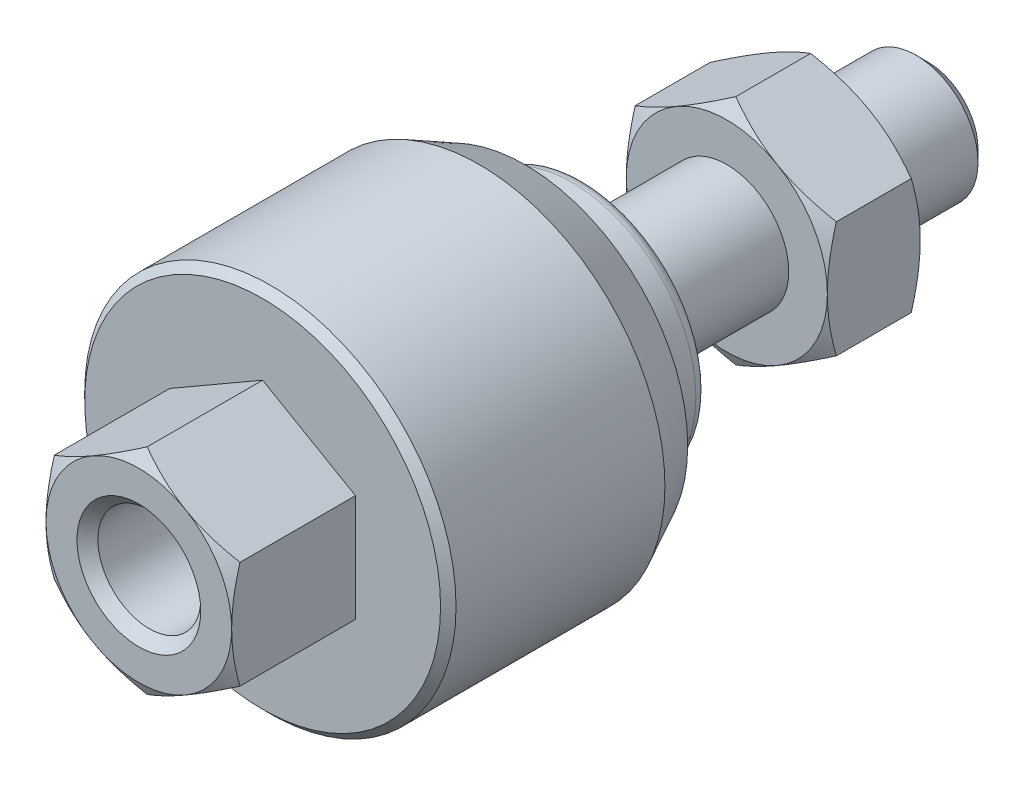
ISO-10303-21;
HEADER;
FILE_DESCRIPTION(('STEP AP214'),'2;1');
FILE_NAME('part.step','',(''),(''),'','','');
FILE_SCHEMA(('AUTOMOTIVE_DESIGN { 1 0 10303 214 1 1 1 1 }'));
ENDSEC;
DATA;
#1=APPLICATION_CONTEXT('core data for automotive mechanical design processes');
#2=APPLICATION_PROTOCOL_DEFINITION('international standard','automotive_design',2000,#1);
#3=PRODUCT_CONTEXT('',#1,'mechanical');
#4=PRODUCT('Part','Part','',(#3));
#5=PRODUCT_RELATED_PRODUCT_CATEGORY('part','',(#4));
#6=PRODUCT_DEFINITION_FORMATION('','',#4);
#7=PRODUCT_DEFINITION_CONTEXT('part definition',#1,'design');
#8=PRODUCT_DEFINITION('design','',#6,#7);
#9=PRODUCT_DEFINITION_SHAPE('','',#8);
#10=(LENGTH_UNIT() NAMED_UNIT(*) SI_UNIT(.MILLI.,.METRE.));
#11=(NAMED_UNIT(*) PLANE_ANGLE_UNIT() SI_UNIT($,.RADIAN.));
#12=(NAMED_UNIT(*) SI_UNIT($,.STERADIAN.) SOLID_ANGLE_UNIT());
#13=UNCERTAINTY_MEASURE_WITH_UNIT(LENGTH_MEASURE(1.E-05),#10,'distance_accuracy_value','');
#14=(GEOMETRIC_REPRESENTATION_CONTEXT(3) GLOBAL_UNCERTAINTY_ASSIGNED_CONTEXT((#13)) GLOBAL_UNIT_ASSIGNED_CONTEXT((#10,
#11,#12)) REPRESENTATION_CONTEXT('',''));
#15=CARTESIAN_POINT('',(0.,0.,0.));
#16=DIRECTION('',(0.,0.,1.));
#17=DIRECTION('',(1.,0.,0.));
#18=AXIS2_PLACEMENT_3D('',#15,#16,#17);
#19=CARTESIAN_POINT('',(0.,0.,12.4194434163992));
#20=DIRECTION('',(0.,0.,-1.));
#21=DIRECTION('',(0.,1.,0.));
#22=AXIS2_PLACEMENT_3D('',#19,#20,#21);
#23=CONICAL_SURFACE('',#22,7.50555349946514,1.0471975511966);
#24=CARTESIAN_POINT('',(-0.00020000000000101,7.50566896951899,12.4193767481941));
#25=CARTESIAN_POINT('',(0.142677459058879,7.42317863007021,12.4669955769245));
#26=CARTESIAN_POINT('',(0.286087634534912,7.34038072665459,12.5124532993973));
#27=CARTESIAN_POINT('',(0.574072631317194,7.17411251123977,12.5984513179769));
#28=CARTESIAN_POINT('',(0.718647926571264,7.09064192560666,12.638989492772));
#29=CARTESIAN_POINT('',(1.15468865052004,6.8388936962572,12.7524289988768));
#30=CARTESIAN_POINT('',(1.44787528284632,6.66962231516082,12.8169521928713));
#31=CARTESIAN_POINT('',(1.88662374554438,6.41631077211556,12.8926134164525));
#32=CARTESIAN_POINT('',(2.0308746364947,6.33302748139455,12.914167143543));
#33=CARTESIAN_POINT('',(2.3200282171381,6.16608458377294,12.9503096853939));
#34=CARTESIAN_POINT('',(2.4649308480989,6.08242501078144,12.9648991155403));
#35=CARTESIAN_POINT('',(2.75498777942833,5.91496056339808,12.9867412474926));
#36=CARTESIAN_POINT('',(2.90014160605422,5.83115596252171,12.9940022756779));
#37=CARTESIAN_POINT('',(3.19057533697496,5.66347396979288,13.0010396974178));
#38=CARTESIAN_POINT('',(3.33585523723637,5.57959658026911,13.0008163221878));
#39=CARTESIAN_POINT('',(3.7338759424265,5.34979921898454,12.9899165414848));
#40=CARTESIAN_POINT('',(3.98648646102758,5.20395446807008,12.9716181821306));
#41=CARTESIAN_POINT('',(4.49002967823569,4.91323365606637,12.9135936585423));
#42=CARTESIAN_POINT('',(4.74096060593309,4.76835861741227,12.8738476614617));
#43=CARTESIAN_POINT('',(5.24551722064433,4.47705272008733,12.7744940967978));
#44=CARTESIAN_POINT('',(5.49907924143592,4.33065861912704,12.714465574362));
#45=CARTESIAN_POINT('',(6.00242193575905,4.04005357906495,12.5782250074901));
#46=CARTESIAN_POINT('',(6.25220905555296,3.89583891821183,12.5020449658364));
#47=CARTESIAN_POINT('',(6.5002,3.75266127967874,12.4193767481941));
#48=B_SPLINE_CURVE_WITH_KNOTS('',3,(#24,#25,#26,#27,#28,#29,#30,#31,#32,#33,#34,#35,#36,#37,#38,
#39,#40,#41,#42,#43,#44,#45,#46,#47),.UNSPECIFIED.,.F.,.F.,(4,2,2,2,2,2,2,2,2,2,2,4),(0.,
0.515105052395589,1.03043143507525,2.06322554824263,2.56697389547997,3.07067772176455,
3.57380860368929,4.07692394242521,4.95279354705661,5.82947446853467,6.72559912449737,
7.61996451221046),.UNSPECIFIED.);
#49=CARTESIAN_POINT('',(0.,7.50555349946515,12.4194434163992));
#50=VERTEX_POINT('',#49);
#51=CARTESIAN_POINT('',(3.25,5.62916512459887,13.));
#52=VERTEX_POINT('',#51);
#53=EDGE_CURVE('E11',#50,#52,#48,.T.);
#54=ORIENTED_EDGE('',*,*,#53,.F.);
#55=CARTESIAN_POINT('',(-6.5002,3.75266127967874,12.4193767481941));
#56=CARTESIAN_POINT('',(-6.35732254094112,3.83515161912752,12.4669955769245));
#57=CARTESIAN_POINT('',(-6.21391236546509,3.91794952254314,12.5124532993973));
#58=CARTESIAN_POINT('',(-5.9259273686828,4.08421773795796,12.5984513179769));
#59=CARTESIAN_POINT('',(-5.78135207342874,4.16768832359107,12.638989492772));
#60=CARTESIAN_POINT('',(-5.34531134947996,4.41943655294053,12.7524289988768));
#61=CARTESIAN_POINT('',(-5.05212471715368,4.58870793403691,12.8169521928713));
#62=CARTESIAN_POINT('',(-4.61337625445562,4.84201947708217,12.8926134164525));
#63=CARTESIAN_POINT('',(-4.46912536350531,4.92530276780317,12.914167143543));
#64=CARTESIAN_POINT('',(-4.17997178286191,5.09224566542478,12.9503096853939));
#65=CARTESIAN_POINT('',(-4.03506915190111,5.17590523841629,12.9648991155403));
#66=CARTESIAN_POINT('',(-3.74501222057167,5.34336968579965,12.9867412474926));
#67=CARTESIAN_POINT('',(-3.59985839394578,5.42717428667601,12.9940022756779));
#68=CARTESIAN_POINT('',(-3.30942466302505,5.59485627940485,13.0010396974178));
#69=CARTESIAN_POINT('',(-3.16414476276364,5.67873366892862,13.0008163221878));
#70=CARTESIAN_POINT('',(-2.7661240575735,5.90853103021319,12.9899165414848));
#71=CARTESIAN_POINT('',(-2.51351353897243,6.05437578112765,12.9716181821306));
#72=CARTESIAN_POINT('',(-2.00997032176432,6.34509659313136,12.9135936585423));
#73=CARTESIAN_POINT('',(-1.75903939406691,6.48997163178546,12.8738476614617));
#74=CARTESIAN_POINT('',(-1.25448277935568,6.7812775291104,12.7744940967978));
#75=CARTESIAN_POINT('',(-1.00092075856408,6.92767163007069,12.714465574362));
#76=CARTESIAN_POINT('',(-0.497578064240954,7.21827667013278,12.5782250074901));
#77=CARTESIAN_POINT('',(-0.247790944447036,7.3624913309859,12.5020449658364));
#78=CARTESIAN_POINT('',(0.00019999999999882,7.50566896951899,12.4193767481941));
#79=B_SPLINE_CURVE_WITH_KNOTS('',3,(#55,#56,#57,#58,#59,#60,#61,#62,#63,#64,#65,#66,#67,#68,#69,
#70,#71,#72,#73,#74,#75,#76,#77,#78),.UNSPECIFIED.,.F.,.F.,(4,2,2,2,2,2,2,2,2,2,2,4),(0.,
0.515105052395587,1.03043143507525,2.06322554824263,2.56697389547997,3.07067772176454,
3.57380860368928,4.07692394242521,4.9527935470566,5.82947446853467,6.72559912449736,
7.61996451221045),.UNSPECIFIED.);
#80=CARTESIAN_POINT('',(-3.25,5.62916512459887,13.));
#81=VERTEX_POINT('',#80);
#82=EDGE_CURVE('E254',#81,#50,#79,.T.);
#83=ORIENTED_EDGE('',*,*,#82,.F.);
#84=CARTESIAN_POINT('',(0.,0.,13.));
#85=DIRECTION('',(0.,0.,1.));
#86=DIRECTION('',(0.,-1.,0.));
#87=AXIS2_PLACEMENT_3D('',#84,#85,#86);
#88=CIRCLE('',#87,6.5);
#89=EDGE_CURVE('E402',#52,#81,#88,.T.);
#90=ORIENTED_EDGE('',*,*,#89,.F.);
#91=EDGE_LOOP('',(#54,#83,#90));
#92=FACE_BOUND('',#91,.T.);
#93=ADVANCED_FACE('F16',(#92),#23,.T.);
#94=CARTESIAN_POINT('',(6.5,3.75277674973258,12.4194434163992));
#95=VERTEX_POINT('',#94);
#96=EDGE_CURVE('E20',#52,#95,#48,.T.);
#97=ORIENTED_EDGE('',*,*,#96,.F.);
#98=CARTESIAN_POINT('',(6.5,0.,13.));
#99=VERTEX_POINT('',#98);
#100=EDGE_CURVE('E398',#99,#52,#88,.T.);
#101=ORIENTED_EDGE('',*,*,#100,.F.);
#102=CARTESIAN_POINT('',(6.5,-9.9529169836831,9.889576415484));
#103=CARTESIAN_POINT('',(6.5,-9.66753022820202,10.0274910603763));
#104=CARTESIAN_POINT('',(6.5,-9.38146872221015,10.1640347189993));
#105=CARTESIAN_POINT('',(6.5,-8.80763137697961,10.4335966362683));
#106=CARTESIAN_POINT('',(6.5,-8.51985525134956,10.5666142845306));
#107=CARTESIAN_POINT('',(6.5,-7.94066929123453,10.8290414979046));
#108=CARTESIAN_POINT('',(6.5,-7.64924808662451,10.9584260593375));
#109=CARTESIAN_POINT('',(6.5,-7.0640104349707,11.2116377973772));
#110=CARTESIAN_POINT('',(6.5,-6.77019411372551,11.3354652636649));
#111=CARTESIAN_POINT('',(6.5,-6.17605150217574,11.5775551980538));
#112=CARTESIAN_POINT('',(6.5,-5.87568957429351,11.6957306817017));
#113=CARTESIAN_POINT('',(6.5,-5.2714226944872,11.9228261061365));
#114=CARTESIAN_POINT('',(6.5,-4.96751735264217,12.031745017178));
#115=CARTESIAN_POINT('',(6.5,-4.35630541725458,12.237400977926));
#116=CARTESIAN_POINT('',(6.5,-4.0490076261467,12.3341639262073));
#117=CARTESIAN_POINT('',(6.5,-3.43004022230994,12.5123642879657));
#118=CARTESIAN_POINT('',(6.5,-3.11837202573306,12.5938065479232));
#119=CARTESIAN_POINT('',(6.5,-2.49046594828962,12.7374159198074));
#120=CARTESIAN_POINT('',(6.5,-2.17422687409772,12.7995778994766));
#121=CARTESIAN_POINT('',(6.5,-1.53789167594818,12.9004257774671));
#122=CARTESIAN_POINT('',(6.5,-1.21779554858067,12.9391116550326));
#123=CARTESIAN_POINT('',(6.5,-0.737141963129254,12.977053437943));
#124=CARTESIAN_POINT('',(6.5,-0.577336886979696,12.9863547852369));
#125=CARTESIAN_POINT('',(6.5,-0.257468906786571,12.9981859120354));
#126=CARTESIAN_POINT('',(6.5,-0.097406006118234,13.0007157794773));
#127=CARTESIAN_POINT('',(6.5,0.222635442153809,12.9989359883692));
#128=CARTESIAN_POINT('',(6.5,0.382614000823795,12.994628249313));
#129=CARTESIAN_POINT('',(6.5,0.702250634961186,12.9792824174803));
#130=CARTESIAN_POINT('',(6.5,0.861908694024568,12.9682439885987));
#131=CARTESIAN_POINT('',(6.5,1.24887053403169,12.9335631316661));
#132=CARTESIAN_POINT('',(6.5,1.47587694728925,12.9065481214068));
#133=CARTESIAN_POINT('',(6.5,1.928150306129,12.840410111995));
#134=CARTESIAN_POINT('',(6.5,2.15341675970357,12.8012838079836));
#135=CARTESIAN_POINT('',(6.5,2.60202427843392,12.7123108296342));
#136=CARTESIAN_POINT('',(6.5,2.82536331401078,12.6624540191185));
#137=CARTESIAN_POINT('',(6.5,3.26974354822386,12.5535412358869));
#138=CARTESIAN_POINT('',(6.5,3.49078496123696,12.4944861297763));
#139=CARTESIAN_POINT('',(6.5,3.93601414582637,12.3670458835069));
#140=CARTESIAN_POINT('',(6.5,4.16014622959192,12.2984675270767));
#141=CARTESIAN_POINT('',(6.5,4.60604131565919,12.1545348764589));
#142=CARTESIAN_POINT('',(6.5,4.82780583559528,12.0791852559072));
#143=CARTESIAN_POINT('',(6.5,5.26807593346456,11.9232664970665));
#144=CARTESIAN_POINT('',(6.5,5.48659282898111,11.8427291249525));
#145=CARTESIAN_POINT('',(6.5,5.9219312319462,11.6769272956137));
#146=CARTESIAN_POINT('',(6.5,6.13875201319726,11.5916609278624));
#147=CARTESIAN_POINT('',(6.5,6.35478510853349,11.5044978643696));
#148=B_SPLINE_CURVE_WITH_KNOTS('',3,(#102,#103,#104,#105,#106,#107,#108,#109,#110,#111,#112,
#113,#114,#115,#116,#117,#118,#119,#120,#121,#122,#123,#124,#125,#126,#127,#128,#129,#130,#131,
#132,#133,#134,#135,#136,#137,#138,#139,#140,#141,#142,#143,#144,#145,#146,#147),.UNSPECIFIED.,
.F.,.F.,(4,2,2,2,2,2,2,2,2,2,2,2,2,2,2,2,2,2,2,2,2,2,4),(0.,0.950904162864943,1.90197187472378,
2.85848216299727,3.81494253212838,4.78314526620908,5.75145556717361,6.71766655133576,
7.68357137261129,8.64973308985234,9.61589566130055,10.0960003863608,10.5760988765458,
11.0560626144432,11.5360503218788,12.2214931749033,12.9071232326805,13.5934038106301,
14.2796197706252,14.9826563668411,15.6852113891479,16.3838119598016,17.082696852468),.UNSPECIFIED.);
#149=EDGE_CURVE('E411',#95,#99,#148,.F.);
#150=ORIENTED_EDGE('',*,*,#149,.F.);
#151=EDGE_LOOP('',(#97,#101,#150));
#152=FACE_BOUND('',#151,.T.);
#153=ADVANCED_FACE('F358',(#152),#23,.T.);
#154=CARTESIAN_POINT('',(6.5,-3.75277674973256,12.4194434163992));
#155=VERTEX_POINT('',#154);
#156=EDGE_CURVE('E252',#99,#155,#148,.F.);
#157=ORIENTED_EDGE('',*,*,#156,.F.);
#158=CARTESIAN_POINT('',(3.25,-5.62916512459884,13.));
#159=VERTEX_POINT('',#158);
#160=EDGE_CURVE('E296',#159,#99,#88,.T.);
#161=ORIENTED_EDGE('',*,*,#160,.F.);
#162=CARTESIAN_POINT('',(6.5002,-3.75266127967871,12.4193767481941));
#163=CARTESIAN_POINT('',(6.35732254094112,-3.83515161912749,12.4669955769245));
#164=CARTESIAN_POINT('',(6.21391236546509,-3.91794952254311,12.5124532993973));
#165=CARTESIAN_POINT('',(5.92592736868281,-4.08421773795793,12.5984513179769));
#166=CARTESIAN_POINT('',(5.78135207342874,-4.16768832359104,12.638989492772));
#167=CARTESIAN_POINT('',(5.34531134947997,-4.4194365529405,12.7524289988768));
#168=CARTESIAN_POINT('',(5.05212471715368,-4.58870793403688,12.8169521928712));
#169=CARTESIAN_POINT('',(4.61337625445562,-4.84201947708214,12.8926134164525));
#170=CARTESIAN_POINT('',(4.46912536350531,-4.92530276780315,12.914167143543));
#171=CARTESIAN_POINT('',(4.17997178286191,-5.09224566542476,12.9503096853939));
#172=CARTESIAN_POINT('',(4.03506915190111,-5.17590523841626,12.9648991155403));
#173=CARTESIAN_POINT('',(3.74501222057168,-5.34336968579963,12.9867412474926));
#174=CARTESIAN_POINT('',(3.59985839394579,-5.42717428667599,12.9940022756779));
#175=CARTESIAN_POINT('',(3.30942466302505,-5.59485627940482,13.0010396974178));
#176=CARTESIAN_POINT('',(3.16414476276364,-5.67873366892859,13.0008163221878));
#177=CARTESIAN_POINT('',(2.7661240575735,-5.90853103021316,12.9899165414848));
#178=CARTESIAN_POINT('',(2.51351353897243,-6.05437578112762,12.9716181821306));
#179=CARTESIAN_POINT('',(2.00997032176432,-6.34509659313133,12.9135936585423));
#180=CARTESIAN_POINT('',(1.75903939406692,-6.48997163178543,12.8738476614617));
#181=CARTESIAN_POINT('',(1.25448277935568,-6.78127752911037,12.7744940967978));
#182=CARTESIAN_POINT('',(1.00092075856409,-6.92767163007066,12.714465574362));
#183=CARTESIAN_POINT('',(0.497578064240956,-7.21827667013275,12.5782250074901));
#184=CARTESIAN_POINT('',(0.247790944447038,-7.36249133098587,12.5020449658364));
#185=CARTESIAN_POINT('',(-0.000199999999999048,-7.50566896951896,12.4193767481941));
#186=B_SPLINE_CURVE_WITH_KNOTS('',3,(#162,#163,#164,#165,#166,#167,#168,#169,#170,#171,#172,
#173,#174,#175,#176,#177,#178,#179,#180,#181,#182,#183,#184,#185),.UNSPECIFIED.,.F.,.F.,(4,2,2,
2,2,2,2,2,2,2,2,4),(0.,0.515105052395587,1.03043143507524,2.06322554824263,2.56697389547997,
3.07067772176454,3.57380860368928,4.07692394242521,4.9527935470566,5.82947446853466,
6.72559912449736,7.61996451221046),.UNSPECIFIED.);
#187=EDGE_CURVE('E242',#155,#159,#186,.T.);
#188=ORIENTED_EDGE('',*,*,#187,.F.);
#189=EDGE_LOOP('',(#157,#161,#188));
#190=FACE_BOUND('',#189,.T.);
#191=ADVANCED_FACE('F364',(#190),#23,.T.);
#192=CARTESIAN_POINT('',(-6.5,3.75277674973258,12.4194434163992));
#193=VERTEX_POINT('',#192);
#194=EDGE_CURVE('E249',#193,#81,#79,.T.);
#195=ORIENTED_EDGE('',*,*,#194,.F.);
#196=CARTESIAN_POINT('',(-6.5,-9.95291698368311,9.889576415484));
#197=CARTESIAN_POINT('',(-6.5,-9.66753022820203,10.0274910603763));
#198=CARTESIAN_POINT('',(-6.5,-9.38146872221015,10.1640347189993));
#199=CARTESIAN_POINT('',(-6.5,-8.80763137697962,10.4335966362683));
#200=CARTESIAN_POINT('',(-6.5,-8.51985525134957,10.5666142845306));
#201=CARTESIAN_POINT('',(-6.5,-7.94066929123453,10.8290414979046));
#202=CARTESIAN_POINT('',(-6.5,-7.64924808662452,10.9584260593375));
#203=CARTESIAN_POINT('',(-6.5,-7.0640104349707,11.2116377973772));
#204=CARTESIAN_POINT('',(-6.5,-6.77019411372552,11.3354652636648));
#205=CARTESIAN_POINT('',(-6.5,-6.17605150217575,11.5775551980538));
#206=CARTESIAN_POINT('',(-6.5,-5.87568957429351,11.6957306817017));
#207=CARTESIAN_POINT('',(-6.5,-5.2714226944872,11.9228261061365));
#208=CARTESIAN_POINT('',(-6.5,-4.96751735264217,12.031745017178));
#209=CARTESIAN_POINT('',(-6.5,-4.35630541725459,12.237400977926));
#210=CARTESIAN_POINT('',(-6.5,-4.04900762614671,12.3341639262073));
#211=CARTESIAN_POINT('',(-6.5,-3.43004022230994,12.5123642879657));
#212=CARTESIAN_POINT('',(-6.5,-3.11837202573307,12.5938065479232));
#213=CARTESIAN_POINT('',(-6.5,-2.49046594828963,12.7374159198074));
#214=CARTESIAN_POINT('',(-6.5,-2.17422687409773,12.7995778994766));
#215=CARTESIAN_POINT('',(-6.5,-1.53789167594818,12.9004257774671));
#216=CARTESIAN_POINT('',(-6.5,-1.21779554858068,12.9391116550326));
#217=CARTESIAN_POINT('',(-6.5,-0.737141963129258,12.977053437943));
#218=CARTESIAN_POINT('',(-6.5,-0.577336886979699,12.9863547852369));
#219=CARTESIAN_POINT('',(-6.5,-0.257468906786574,12.9981859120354));
#220=CARTESIAN_POINT('',(-6.5,-0.0974060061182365,13.0007157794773));
#221=CARTESIAN_POINT('',(-6.5,0.222635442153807,12.9989359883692));
#222=CARTESIAN_POINT('',(-6.5,0.382614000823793,12.994628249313));
#223=CARTESIAN_POINT('',(-6.5,0.702250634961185,12.9792824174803));
#224=CARTESIAN_POINT('',(-6.5,0.861908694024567,12.9682439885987));
#225=CARTESIAN_POINT('',(-6.5,1.24887053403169,12.9335631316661));
#226=CARTESIAN_POINT('',(-6.5,1.47587694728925,12.9065481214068));
#227=CARTESIAN_POINT('',(-6.5,1.928150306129,12.840410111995));
#228=CARTESIAN_POINT('',(-6.5,2.15341675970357,12.8012838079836));
#229=CARTESIAN_POINT('',(-6.5,2.60202427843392,12.7123108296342));
#230=CARTESIAN_POINT('',(-6.5,2.82536331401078,12.6624540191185));
#231=CARTESIAN_POINT('',(-6.5,3.26974354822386,12.5535412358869));
#232=CARTESIAN_POINT('',(-6.5,3.49078496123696,12.4944861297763));
#233=CARTESIAN_POINT('',(-6.5,3.93601414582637,12.3670458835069));
#234=CARTESIAN_POINT('',(-6.5,4.16014622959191,12.2984675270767));
#235=CARTESIAN_POINT('',(-6.5,4.60604131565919,12.1545348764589));
#236=CARTESIAN_POINT('',(-6.5,4.82780583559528,12.0791852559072));
#237=CARTESIAN_POINT('',(-6.5,5.26807593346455,11.9232664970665));
#238=CARTESIAN_POINT('',(-6.5,5.48659282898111,11.8427291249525));
#239=CARTESIAN_POINT('',(-6.5,5.9219312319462,11.6769272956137));
#240=CARTESIAN_POINT('',(-6.5,6.13875201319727,11.5916609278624));
#241=CARTESIAN_POINT('',(-6.5,6.35478510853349,11.5044978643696));
#242=B_SPLINE_CURVE_WITH_KNOTS('',3,(#196,#197,#198,#199,#200,#201,#202,#203,#204,#205,#206,
#207,#208,#209,#210,#211,#212,#213,#214,#215,#216,#217,#218,#219,#220,#221,#222,#223,#224,#225,
#226,#227,#228,#229,#230,#231,#232,#233,#234,#235,#236,#237,#238,#239,#240,#241),.UNSPECIFIED.,
.F.,.F.,(4,2,2,2,2,2,2,2,2,2,2,2,2,2,2,2,2,2,2,2,2,2,4),(0.,0.950904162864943,1.90197187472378,
2.85848216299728,3.81494253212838,4.78314526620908,5.75145556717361,6.71766655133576,
7.68357137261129,8.64973308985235,9.61589566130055,10.0960003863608,10.5760988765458,
11.0560626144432,11.5360503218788,12.2214931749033,12.9071232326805,13.5934038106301,
14.2796197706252,14.9826563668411,15.6852113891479,16.3838119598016,17.082696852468),.UNSPECIFIED.);
#243=CARTESIAN_POINT('',(-6.5,0.,13.));
#244=VERTEX_POINT('',#243);
#245=EDGE_CURVE('E241',#244,#193,#242,.T.);
#246=ORIENTED_EDGE('',*,*,#245,.F.);
#247=EDGE_CURVE('E404',#81,#244,#88,.T.);
#248=ORIENTED_EDGE('',*,*,#247,.F.);
#249=EDGE_LOOP('',(#195,#246,#248));
#250=FACE_BOUND('',#249,.T.);
#251=ADVANCED_FACE('F380',(#250),#23,.T.);
#252=CARTESIAN_POINT('',(0.,-7.50555349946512,12.4194434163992));
#253=VERTEX_POINT('',#252);
#254=EDGE_CURVE('E239',#159,#253,#186,.T.);
#255=ORIENTED_EDGE('',*,*,#254,.F.);
#256=CARTESIAN_POINT('',(-3.25,-5.62916512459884,13.));
#257=VERTEX_POINT('',#256);
#258=EDGE_CURVE('E388',#257,#159,#88,.T.);
#259=ORIENTED_EDGE('',*,*,#258,.F.);
#260=CARTESIAN_POINT('',(0.000200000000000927,-7.50566896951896,12.4193767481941));
#261=CARTESIAN_POINT('',(-0.14267745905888,-7.42317863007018,12.4669955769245));
#262=CARTESIAN_POINT('',(-0.286087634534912,-7.34038072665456,12.5124532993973));
#263=CARTESIAN_POINT('',(-0.574072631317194,-7.17411251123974,12.5984513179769));
#264=CARTESIAN_POINT('',(-0.718647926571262,-7.09064192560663,12.638989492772));
#265=CARTESIAN_POINT('',(-1.15468865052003,-6.83889369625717,12.7524289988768));
#266=CARTESIAN_POINT('',(-1.44787528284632,-6.66962231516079,12.8169521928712));
#267=CARTESIAN_POINT('',(-1.88662374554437,-6.41631077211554,12.8926134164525));
#268=CARTESIAN_POINT('',(-2.03087463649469,-6.33302748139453,12.914167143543));
#269=CARTESIAN_POINT('',(-2.32002821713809,-6.16608458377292,12.9503096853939));
#270=CARTESIAN_POINT('',(-2.46493084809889,-6.08242501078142,12.9648991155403));
#271=CARTESIAN_POINT('',(-2.75498777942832,-5.91496056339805,12.9867412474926));
#272=CARTESIAN_POINT('',(-2.90014160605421,-5.83115596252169,12.9940022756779));
#273=CARTESIAN_POINT('',(-3.19057533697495,-5.66347396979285,13.0010396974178));
#274=CARTESIAN_POINT('',(-3.33585523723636,-5.57959658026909,13.0008163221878));
#275=CARTESIAN_POINT('',(-3.73387594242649,-5.34979921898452,12.9899165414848));
#276=CARTESIAN_POINT('',(-3.98648646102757,-5.20395446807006,12.9716181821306));
#277=CARTESIAN_POINT('',(-4.49002967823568,-4.91323365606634,12.9135936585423));
#278=CARTESIAN_POINT('',(-4.74096060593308,-4.76835861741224,12.8738476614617));
#279=CARTESIAN_POINT('',(-5.24551722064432,-4.4770527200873,12.7744940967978));
#280=CARTESIAN_POINT('',(-5.49907924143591,-4.33065861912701,12.714465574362));
#281=CARTESIAN_POINT('',(-6.00242193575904,-4.04005357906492,12.5782250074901));
#282=CARTESIAN_POINT('',(-6.25220905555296,-3.8958389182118,12.5020449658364));
#283=CARTESIAN_POINT('',(-6.5002,-3.75266127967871,12.4193767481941));
#284=B_SPLINE_CURVE_WITH_KNOTS('',3,(#260,#261,#262,#263,#264,#265,#266,#267,#268,#269,#270,
#271,#272,#273,#274,#275,#276,#277,#278,#279,#280,#281,#282,#283),.UNSPECIFIED.,.F.,.F.,(4,2,2,
2,2,2,2,2,2,2,2,4),(0.,0.515105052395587,1.03043143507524,2.06322554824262,2.56697389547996,
3.07067772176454,3.57380860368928,4.0769239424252,4.9527935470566,5.82947446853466,
6.72559912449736,7.61996451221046),.UNSPECIFIED.);
#285=EDGE_CURVE('E44',#253,#257,#284,.T.);
#286=ORIENTED_EDGE('',*,*,#285,.F.);
#287=EDGE_LOOP('',(#255,#259,#286));
#288=FACE_BOUND('',#287,.T.);
#289=ADVANCED_FACE('F369',(#288),#23,.T.);
#290=CARTESIAN_POINT('',(-6.5,-3.75277674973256,12.4194434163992));
#291=VERTEX_POINT('',#290);
#292=EDGE_CURVE('E228',#291,#244,#242,.T.);
#293=ORIENTED_EDGE('',*,*,#292,.F.);
#294=EDGE_CURVE('E216',#257,#291,#284,.T.);
#295=ORIENTED_EDGE('',*,*,#294,.F.);
#296=EDGE_CURVE('E237',#244,#257,#88,.T.);
#297=ORIENTED_EDGE('',*,*,#296,.F.);
#298=EDGE_LOOP('',(#293,#295,#297));
#299=FACE_BOUND('',#298,.T.);
#300=ADVANCED_FACE('F235',(#299),#23,.T.);
#301=CARTESIAN_POINT('',(0.,0.,0.));
#302=DIRECTION('',(0.,0.,1.));
#303=DIRECTION('',(1.,0.,0.));
#304=AXIS2_PLACEMENT_3D('',#301,#302,#303);
#305=CYLINDRICAL_SURFACE('',#304,4.);
#306=CARTESIAN_POINT('',(0.,0.,20.));
#307=DIRECTION('',(0.,0.,1.));
#308=DIRECTION('',(1.,0.,0.));
#309=AXIS2_PLACEMENT_3D('',#306,#307,#308);
#310=CIRCLE('',#309,4.);
#311=CARTESIAN_POINT('',(4.,0.,20.));
#312=VERTEX_POINT('',#311);
#313=CARTESIAN_POINT('',(-4.,0.,20.));
#314=VERTEX_POINT('',#313);
#315=EDGE_CURVE('E623',#312,#314,#310,.T.);
#316=ORIENTED_EDGE('',*,*,#315,.F.);
#317=EDGE_CURVE('E622',#314,#312,#310,.T.);
#318=ORIENTED_EDGE('',*,*,#317,.F.);
#319=EDGE_LOOP('',(#316,#318));
#320=FACE_BOUND('',#319,.T.);
#321=CARTESIAN_POINT('',(0.,0.,13.));
#322=DIRECTION('',(0.,0.,1.));
#323=DIRECTION('',(0.,-1.,0.));
#324=AXIS2_PLACEMENT_3D('',#321,#322,#323);
#325=CIRCLE('',#324,4.);
#326=CARTESIAN_POINT('',(0.,-3.99999999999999,13.));
#327=VERTEX_POINT('',#326);
#328=EDGE_CURVE('E224',#327,#327,#325,.F.);
#329=ORIENTED_EDGE('',*,*,#328,.F.);
#330=EDGE_LOOP('',(#329));
#331=FACE_BOUND('',#330,.T.);
#332=ADVANCED_FACE('F368',(#320,#331),#305,.T.);
#333=CARTESIAN_POINT('',(0.,7.52820323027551,43.));
#334=DIRECTION('',(0.,0.,-1.));
#335=DIRECTION('',(-1.,0.,0.));
#336=AXIS2_PLACEMENT_3D('',#333,#334,#335);
#337=PLANE('',#336);
#338=CARTESIAN_POINT('',(0.,0.,43.));
#339=DIRECTION('',(0.,0.,1.));
#340=DIRECTION('',(1.,0.,0.));
#341=AXIS2_PLACEMENT_3D('',#338,#339,#340);
#342=CIRCLE('',#341,11.5);
#343=CARTESIAN_POINT('',(11.5,0.,43.));
#344=VERTEX_POINT('',#343);
#345=EDGE_CURVE('E651',#344,#344,#342,.T.);
#346=ORIENTED_EDGE('',*,*,#345,.T.);
#347=EDGE_LOOP('',(#346));
#348=FACE_BOUND('',#347,.T.);
#349=DIRECTION('',(0.,-1.,0.));
#350=VECTOR('',#349,1.);
#351=CARTESIAN_POINT('',(-6.,3.46410161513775,43.));
#352=LINE('',#351,#350);
#353=CARTESIAN_POINT('',(-6.,3.46410161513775,43.));
#354=VERTEX_POINT('',#353);
#355=CARTESIAN_POINT('',(-6.,-3.46410161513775,43.));
#356=VERTEX_POINT('',#355);
#357=EDGE_CURVE('E460',#354,#356,#352,.T.);
#358=ORIENTED_EDGE('',*,*,#357,.F.);
#359=DIRECTION('',(-0.866025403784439,-0.5,0.));
#360=VECTOR('',#359,1.);
#361=CARTESIAN_POINT('',(0.,6.92820323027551,43.));
#362=LINE('',#361,#360);
#363=CARTESIAN_POINT('',(0.,6.92820323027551,43.));
#364=VERTEX_POINT('',#363);
#365=EDGE_CURVE('E457',#364,#354,#362,.T.);
#366=ORIENTED_EDGE('',*,*,#365,.F.);
#367=DIRECTION('',(-0.866025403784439,0.5,0.));
#368=VECTOR('',#367,1.);
#369=CARTESIAN_POINT('',(6.,3.46410161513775,43.));
#370=LINE('',#369,#368);
#371=CARTESIAN_POINT('',(6.,3.46410161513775,43.));
#372=VERTEX_POINT('',#371);
#373=EDGE_CURVE('E454',#372,#364,#370,.T.);
#374=ORIENTED_EDGE('',*,*,#373,.F.);
#375=DIRECTION('',(0.,1.,0.));
#376=VECTOR('',#375,1.);
#377=CARTESIAN_POINT('',(6.,-3.46410161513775,43.));
#378=LINE('',#377,#376);
#379=CARTESIAN_POINT('',(6.,-3.46410161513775,43.));
#380=VERTEX_POINT('',#379);
#381=EDGE_CURVE('E451',#380,#372,#378,.T.);
#382=ORIENTED_EDGE('',*,*,#381,.F.);
#383=DIRECTION('',(0.866025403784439,0.5,0.));
#384=VECTOR('',#383,1.);
#385=CARTESIAN_POINT('',(0.,-6.92820323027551,43.));
#386=LINE('',#385,#384);
#387=CARTESIAN_POINT('',(0.,-6.92820323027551,43.));
#388=VERTEX_POINT('',#387);
#389=EDGE_CURVE('E445',#388,#380,#386,.T.);
#390=ORIENTED_EDGE('',*,*,#389,.F.);
#391=DIRECTION('',(0.866025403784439,-0.5,0.));
#392=VECTOR('',#391,1.);
#393=CARTESIAN_POINT('',(-6.,-3.46410161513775,43.));
#394=LINE('',#393,#392);
#395=EDGE_CURVE('E443',#356,#388,#394,.T.);
#396=ORIENTED_EDGE('',*,*,#395,.F.);
#397=EDGE_LOOP('',(#358,#366,#374,#382,#390,#396));
#398=FACE_BOUND('',#397,.T.);
#399=ADVANCED_FACE('F376',(#348,#398),#337,.F.);
#400=CARTESIAN_POINT('',(0.,0.,42.5));
#401=DIRECTION('',(0.,0.,-1.));
#402=DIRECTION('',(-1.,0.,0.));
#403=AXIS2_PLACEMENT_3D('',#400,#401,#402);
#404=CONICAL_SURFACE('',#403,12.,0.785398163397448);
#405=ORIENTED_EDGE('',*,*,#345,.F.);
#406=EDGE_LOOP('',(#405));
#407=FACE_BOUND('',#406,.T.);
#408=CARTESIAN_POINT('',(0.,0.,42.5));
#409=DIRECTION('',(0.,0.,1.));
#410=DIRECTION('',(1.,0.,0.));
#411=AXIS2_PLACEMENT_3D('',#408,#409,#410);
#412=CIRCLE('',#411,12.);
#413=CARTESIAN_POINT('',(12.,0.,42.5));
#414=VERTEX_POINT('',#413);
#415=EDGE_CURVE('E648',#414,#414,#412,.T.);
#416=ORIENTED_EDGE('',*,*,#415,.T.);
#417=EDGE_LOOP('',(#416));
#418=FACE_BOUND('',#417,.T.);
#419=ADVANCED_FACE('F1037',(#407,#418),#404,.T.);
#420=CARTESIAN_POINT('',(0.,0.,0.));
#421=DIRECTION('',(0.,0.,1.));
#422=DIRECTION('',(1.,0.,0.));
#423=AXIS2_PLACEMENT_3D('',#420,#421,#422);
#424=CYLINDRICAL_SURFACE('',#423,12.);
#425=ORIENTED_EDGE('',*,*,#415,.F.);
#426=EDGE_LOOP('',(#425));
#427=FACE_BOUND('',#426,.T.);
#428=CARTESIAN_POINT('',(0.,0.,29.));
#429=DIRECTION('',(0.,0.,1.));
#430=DIRECTION('',(1.,0.,0.));
#431=AXIS2_PLACEMENT_3D('',#428,#429,#430);
#432=CIRCLE('',#431,12.);
#433=CARTESIAN_POINT('',(12.,0.,29.));
#434=VERTEX_POINT('',#433);
#435=EDGE_CURVE('E645',#434,#434,#432,.T.);
#436=ORIENTED_EDGE('',*,*,#435,.T.);
#437=EDGE_LOOP('',(#436));
#438=FACE_BOUND('',#437,.T.);
#439=ADVANCED_FACE('F1026',(#427,#438),#424,.T.);
#440=CARTESIAN_POINT('',(0.,0.,26.));
#441=DIRECTION('',(0.,0.,1.));
#442=DIRECTION('',(1.,0.,0.));
#443=AXIS2_PLACEMENT_3D('',#440,#441,#442);
#444=CONICAL_SURFACE('',#443,10.4714236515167,0.471238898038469);
#445=ORIENTED_EDGE('',*,*,#435,.F.);
#446=EDGE_LOOP('',(#445));
#447=FACE_BOUND('',#446,.T.);
#448=CARTESIAN_POINT('',(0.,0.,26.));
#449=DIRECTION('',(0.,0.,1.));
#450=DIRECTION('',(1.,0.,0.));
#451=AXIS2_PLACEMENT_3D('',#448,#449,#450);
#452=CIRCLE('',#451,10.4714236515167);
#453=CARTESIAN_POINT('',(10.4714236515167,0.,26.));
#454=VERTEX_POINT('',#453);
#455=EDGE_CURVE('E642',#454,#454,#452,.T.);
#456=ORIENTED_EDGE('',*,*,#455,.T.);
#457=EDGE_LOOP('',(#456));
#458=FACE_BOUND('',#457,.T.);
#459=ADVANCED_FACE('F1015',(#447,#458),#444,.T.);
#460=CARTESIAN_POINT('',(0.,10.4714236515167,26.));
#461=DIRECTION('',(0.,0.,1.));
#462=DIRECTION('',(1.,0.,0.));
#463=AXIS2_PLACEMENT_3D('',#460,#461,#462);
#464=PLANE('',#463);
#465=CARTESIAN_POINT('',(0.,0.,26.));
#466=DIRECTION('',(0.,0.,1.));
#467=DIRECTION('',(1.,0.,0.));
#468=AXIS2_PLACEMENT_3D('',#465,#466,#467);
#469=CIRCLE('',#468,8.);
#470=CARTESIAN_POINT('',(8.,0.,26.));
#471=VERTEX_POINT('',#470);
#472=EDGE_CURVE('E671',#471,#471,#469,.F.);
#473=ORIENTED_EDGE('',*,*,#472,.F.);
#474=EDGE_LOOP('',(#473));
#475=FACE_BOUND('',#474,.T.);
#476=ORIENTED_EDGE('',*,*,#455,.F.);
#477=EDGE_LOOP('',(#476));
#478=FACE_BOUND('',#477,.T.);
#479=ADVANCED_FACE('F599',(#475,#478),#464,.F.);
#480=CARTESIAN_POINT('',(0.,3.5,23.));
#481=DIRECTION('',(0.,0.,1.));
#482=DIRECTION('',(1.,0.,0.));
#483=AXIS2_PLACEMENT_3D('',#480,#481,#482);
#484=PLANE('',#483);
#485=DIRECTION('',(0.,1.,0.));
#486=VECTOR('',#485,1.);
#487=CARTESIAN_POINT('',(-4.,-8.,23.));
#488=LINE('',#487,#486);
#489=CARTESIAN_POINT('',(-4.,-1.57797338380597,23.));
#490=VERTEX_POINT('',#489);
#491=CARTESIAN_POINT('',(-4.,1.57797338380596,23.));
#492=VERTEX_POINT('',#491);
#493=EDGE_CURVE('E541',#490,#492,#488,.T.);
#494=ORIENTED_EDGE('',*,*,#493,.F.);
#495=CARTESIAN_POINT('',(0.,0.,23.));
#496=DIRECTION('',(0.,0.,1.));
#497=DIRECTION('',(1.,0.,0.));
#498=AXIS2_PLACEMENT_3D('',#495,#496,#497);
#499=CIRCLE('',#498,4.3);
#500=EDGE_CURVE('E540',#492,#490,#499,.T.);
#501=ORIENTED_EDGE('',*,*,#500,.F.);
#502=EDGE_LOOP('',(#494,#501));
#503=FACE_BOUND('',#502,.T.);
#504=ADVANCED_FACE('F995',(#503),#484,.F.);
#505=DIRECTION('',(0.,-1.,0.));
#506=VECTOR('',#505,1.);
#507=CARTESIAN_POINT('',(4.,8.,23.));
#508=LINE('',#507,#506);
#509=CARTESIAN_POINT('',(4.,1.57797338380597,23.));
#510=VERTEX_POINT('',#509);
#511=CARTESIAN_POINT('',(4.,-1.57797338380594,23.));
#512=VERTEX_POINT('',#511);
#513=EDGE_CURVE('E544',#510,#512,#508,.T.);
#514=ORIENTED_EDGE('',*,*,#513,.F.);
#515=EDGE_CURVE('E537',#512,#510,#499,.T.);
#516=ORIENTED_EDGE('',*,*,#515,.F.);
#517=EDGE_LOOP('',(#514,#516));
#518=FACE_BOUND('',#517,.T.);
#519=ADVANCED_FACE('F984',(#518),#484,.F.);
#520=CARTESIAN_POINT('',(0.,0.,23.));
#521=DIRECTION('',(0.,0.,-1.));
#522=DIRECTION('',(-1.,0.,0.));
#523=AXIS2_PLACEMENT_3D('',#520,#521,#522);
#524=CONICAL_SURFACE('',#523,4.3,1.29130986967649);
#525=CARTESIAN_POINT('',(0.,0.,22.2310422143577));
#526=DIRECTION('',(0.,0.,1.));
#527=DIRECTION('',(1.,0.,0.));
#528=AXIS2_PLACEMENT_3D('',#525,#526,#527);
#529=CIRCLE('',#528,6.97931034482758);
#530=CARTESIAN_POINT('',(6.97931034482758,0.,22.2310422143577));
#531=VERTEX_POINT('',#530);
#532=EDGE_CURVE('E534',#531,#531,#529,.T.);
#533=ORIENTED_EDGE('',*,*,#532,.F.);
#534=EDGE_LOOP('',(#533));
#535=FACE_BOUND('',#534,.T.);
#536=CARTESIAN_POINT('',(0.,0.,23.));
#537=DIRECTION('',(0.,0.,1.));
#538=DIRECTION('',(1.,0.,0.));
#539=AXIS2_PLACEMENT_3D('',#536,#537,#538);
#540=CIRCLE('',#539,4.3);
#541=EDGE_CURVE('E639',#510,#492,#540,.T.);
#542=ORIENTED_EDGE('',*,*,#541,.T.);
#543=ORIENTED_EDGE('',*,*,#500,.T.);
#544=EDGE_CURVE('E638',#490,#512,#540,.T.);
#545=ORIENTED_EDGE('',*,*,#544,.T.);
#546=ORIENTED_EDGE('',*,*,#515,.T.);
#547=EDGE_LOOP('',(#542,#543,#545,#546));
#548=FACE_BOUND('',#547,.T.);
#549=ADVANCED_FACE('F973',(#535,#548),#524,.F.);
#550=CARTESIAN_POINT('',(0.,0.,23.));
#551=DIRECTION('',(0.,0.,1.));
#552=DIRECTION('',(1.,0.,0.));
#553=AXIS2_PLACEMENT_3D('',#550,#551,#552);
#554=TOROIDAL_SURFACE('',#553,7.2,0.8);
#555=CARTESIAN_POINT('',(0.,0.,23.));
#556=DIRECTION('',(0.,0.,1.));
#557=DIRECTION('',(1.,0.,0.));
#558=AXIS2_PLACEMENT_3D('',#555,#556,#557);
#559=CIRCLE('',#558,8.);
#560=CARTESIAN_POINT('',(8.,0.,23.));
#561=VERTEX_POINT('',#560);
#562=EDGE_CURVE('E531',#561,#561,#559,.T.);
#563=ORIENTED_EDGE('',*,*,#562,.F.);
#564=EDGE_LOOP('',(#563));
#565=FACE_BOUND('',#564,.T.);
#566=ORIENTED_EDGE('',*,*,#532,.T.);
#567=EDGE_LOOP('',(#566));
#568=FACE_BOUND('',#567,.T.);
#569=ADVANCED_FACE('F962',(#565,#568),#554,.T.);
#570=CARTESIAN_POINT('',(0.,0.,-50.));
#571=DIRECTION('',(0.,0.,1.));
#572=DIRECTION('',(1.,0.,0.));
#573=AXIS2_PLACEMENT_3D('',#570,#571,#572);
#574=CYLINDRICAL_SURFACE('',#573,8.);
#575=ORIENTED_EDGE('',*,*,#472,.T.);
#576=EDGE_LOOP('',(#575));
#577=FACE_BOUND('',#576,.T.);
#578=ORIENTED_EDGE('',*,*,#562,.T.);
#579=EDGE_LOOP('',(#578));
#580=FACE_BOUND('',#579,.T.);
#581=ADVANCED_FACE('F511',(#577,#580),#574,.T.);
#582=CARTESIAN_POINT('',(0.,0.,0.));
#583=DIRECTION('',(0.,0.,1.));
#584=DIRECTION('',(1.,0.,0.));
#585=AXIS2_PLACEMENT_3D('',#582,#583,#584);
#586=CYLINDRICAL_SURFACE('',#585,4.5);
#587=DIRECTION('',(0.,0.,1.));
#588=VECTOR('',#587,1.);
#589=CARTESIAN_POINT('',(4.,2.06155281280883,0.));
#590=LINE('',#589,#588);
#591=CARTESIAN_POINT('',(4.,2.06155281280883,20.2));
#592=VERTEX_POINT('',#591);
#593=CARTESIAN_POINT('',(4.,2.06155281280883,22.8));
#594=VERTEX_POINT('',#593);
#595=EDGE_CURVE('E612',#592,#594,#590,.T.);
#596=ORIENTED_EDGE('',*,*,#595,.F.);
#597=CARTESIAN_POINT('',(0.,0.,20.2));
#598=DIRECTION('',(0.,0.,1.));
#599=DIRECTION('',(1.,0.,0.));
#600=AXIS2_PLACEMENT_3D('',#597,#598,#599);
#601=CIRCLE('',#600,4.5);
#602=CARTESIAN_POINT('',(-4.,2.06155281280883,20.2));
#603=VERTEX_POINT('',#602);
#604=EDGE_CURVE('E631',#592,#603,#601,.T.);
#605=ORIENTED_EDGE('',*,*,#604,.T.);
#606=DIRECTION('',(0.,0.,1.));
#607=VECTOR('',#606,1.);
#608=CARTESIAN_POINT('',(-4.,2.06155281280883,0.));
#609=LINE('',#608,#607);
#610=CARTESIAN_POINT('',(-4.,2.06155281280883,22.8));
#611=VERTEX_POINT('',#610);
#612=EDGE_CURVE('E591',#611,#603,#609,.F.);
#613=ORIENTED_EDGE('',*,*,#612,.F.);
#614=CARTESIAN_POINT('',(0.,0.,22.8));
#615=DIRECTION('',(0.,0.,1.));
#616=DIRECTION('',(1.,0.,0.));
#617=AXIS2_PLACEMENT_3D('',#614,#615,#616);
#618=CIRCLE('',#617,4.5);
#619=EDGE_CURVE('E635',#594,#611,#618,.T.);
#620=ORIENTED_EDGE('',*,*,#619,.F.);
#621=EDGE_LOOP('',(#596,#605,#613,#620));
#622=FACE_BOUND('',#621,.T.);
#623=ADVANCED_FACE('F598',(#622),#586,.T.);
#624=CARTESIAN_POINT('',(0.,0.,20.));
#625=DIRECTION('',(0.,0.,1.));
#626=DIRECTION('',(1.,0.,0.));
#627=AXIS2_PLACEMENT_3D('',#624,#625,#626);
#628=CONICAL_SURFACE('',#627,4.3,0.785398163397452);
#629=CARTESIAN_POINT('',(4.,-9.0576133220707,25.6015331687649));
#630=CARTESIAN_POINT('',(4.,-8.92437467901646,25.4796528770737));
#631=CARTESIAN_POINT('',(4.,-8.79091999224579,25.3580088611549));
#632=CARTESIAN_POINT('',(4.,-8.52351635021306,25.1152631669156));
#633=CARTESIAN_POINT('',(4.,-8.38956739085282,24.9941614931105));
#634=CARTESIAN_POINT('',(4.,-7.98682502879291,24.6317199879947));
#635=CARTESIAN_POINT('',(4.,-7.71719974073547,24.3913019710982));
#636=CARTESIAN_POINT('',(4.,-7.17321054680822,23.9120798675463));
#637=CARTESIAN_POINT('',(4.,-6.89882680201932,23.6732982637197));
#638=CARTESIAN_POINT('',(4.,-6.3462213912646,23.2002695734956));
#639=CARTESIAN_POINT('',(4.,-6.06800022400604,22.9660219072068));
#640=CARTESIAN_POINT('',(4.,-5.55139371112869,22.5410558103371));
#641=CARTESIAN_POINT('',(4.,-5.31378936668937,22.3493900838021));
#642=CARTESIAN_POINT('',(4.,-4.83356444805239,21.9722502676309));
#643=CARTESIAN_POINT('',(4.,-4.59094248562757,21.7867779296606));
#644=CARTESIAN_POINT('',(4.,-4.22216031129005,21.515477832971));
#645=CARTESIAN_POINT('',(4.,-4.09850294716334,21.4262490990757));
#646=CARTESIAN_POINT('',(4.,-3.8492365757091,21.2505662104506));
#647=CARTESIAN_POINT('',(4.,-3.72362767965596,21.1641118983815));
#648=CARTESIAN_POINT('',(4.,-3.47019545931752,20.9946562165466));
#649=CARTESIAN_POINT('',(4.,-3.34237341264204,20.9116529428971));
#650=CARTESIAN_POINT('',(4.,-3.08405119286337,20.7498739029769));
#651=CARTESIAN_POINT('',(4.,-2.95355076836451,20.6710985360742));
#652=CARTESIAN_POINT('',(4.,-2.69201563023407,20.5203475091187));
#653=CARTESIAN_POINT('',(4.,-2.5610401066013,20.4482697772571));
#654=CARTESIAN_POINT('',(4.,-2.29574647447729,20.310596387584));
#655=CARTESIAN_POINT('',(4.,-2.16142937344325,20.2449988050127));
#656=CARTESIAN_POINT('',(4.,-1.88922939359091,20.1220428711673));
#657=CARTESIAN_POINT('',(4.,-1.7513509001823,20.0646749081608));
#658=CARTESIAN_POINT('',(4.,-1.47174049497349,19.9601913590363));
#659=CARTESIAN_POINT('',(4.,-1.33000968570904,19.9130728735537));
#660=CARTESIAN_POINT('',(4.,-1.07131107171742,19.8395075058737));
#661=CARTESIAN_POINT('',(4.,-0.954985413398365,19.8108156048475));
#662=CARTESIAN_POINT('',(4.,-0.720413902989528,19.7627370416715));
#663=CARTESIAN_POINT('',(4.,-0.602168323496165,19.7433490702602));
#664=CARTESIAN_POINT('',(4.,-0.364714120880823,19.7148679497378));
#665=CARTESIAN_POINT('',(4.,-0.245508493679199,19.7057501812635));
#666=CARTESIAN_POINT('',(4.,-0.00675492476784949,19.6982261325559));
#667=CARTESIAN_POINT('',(4.,0.112793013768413,19.6998197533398));
#668=CARTESIAN_POINT('',(4.,0.351149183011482,19.7136216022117));
#669=CARTESIAN_POINT('',(4.,0.469958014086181,19.7258196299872));
#670=CARTESIAN_POINT('',(4.,0.706117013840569,19.7601653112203));
#671=CARTESIAN_POINT('',(4.,0.823467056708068,19.7823138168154));
#672=CARTESIAN_POINT('',(4.,1.05643602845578,19.835595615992));
#673=CARTESIAN_POINT('',(4.,1.17204905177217,19.8667544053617));
#674=CARTESIAN_POINT('',(4.,1.40087287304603,19.9368119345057));
#675=CARTESIAN_POINT('',(4.,1.51408373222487,19.9757104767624));
#676=CARTESIAN_POINT('',(4.,1.76935938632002,20.071841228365));
#677=CARTESIAN_POINT('',(4.,1.91063527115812,20.1311579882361));
#678=CARTESIAN_POINT('',(4.,2.18934943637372,20.2582732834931));
#679=CARTESIAN_POINT('',(4.,2.32678572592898,20.3260761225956));
#680=CARTESIAN_POINT('',(4.,2.59838647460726,20.4684606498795));
#681=CARTESIAN_POINT('',(4.,2.73254466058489,20.5430542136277));
#682=CARTESIAN_POINT('',(4.,2.9978027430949,20.6975190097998));
#683=CARTESIAN_POINT('',(4.,3.12890202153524,20.7773912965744));
#684=CARTESIAN_POINT('',(4.,3.38977778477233,20.9421622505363));
#685=CARTESIAN_POINT('',(4.,3.51952685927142,21.0271041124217));
#686=CARTESIAN_POINT('',(4.,3.77672083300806,21.2004177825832));
#687=CARTESIAN_POINT('',(4.,3.90416553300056,21.2887898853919));
#688=CARTESIAN_POINT('',(4.,4.15711717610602,21.468334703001));
#689=CARTESIAN_POINT('',(4.,4.2826235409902,21.5595082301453));
#690=CARTESIAN_POINT('',(4.,4.5319503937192,21.7441346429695));
#691=CARTESIAN_POINT('',(4.,4.65577082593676,21.8375876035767));
#692=CARTESIAN_POINT('',(4.,4.96886852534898,22.0776756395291));
#693=CARTESIAN_POINT('',(4.,5.15714792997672,22.2256112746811));
#694=CARTESIAN_POINT('',(4.,5.53093204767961,22.5248588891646));
#695=CARTESIAN_POINT('',(4.,5.71643729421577,22.6761702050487));
#696=CARTESIAN_POINT('',(4.,6.08536219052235,22.9815459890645));
#697=CARTESIAN_POINT('',(4.,6.26878044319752,23.1356121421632));
#698=CARTESIAN_POINT('',(4.,6.63382616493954,23.4458652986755));
#699=CARTESIAN_POINT('',(4.,6.81545354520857,23.6020524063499));
#700=CARTESIAN_POINT('',(4.,7.34449040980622,24.061310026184));
#701=CARTESIAN_POINT('',(4.,7.68991360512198,24.3666686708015));
#702=CARTESIAN_POINT('',(4.,8.20498430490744,24.8277607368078));
#703=CARTESIAN_POINT('',(4.,8.37607823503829,24.9818885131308));
#704=CARTESIAN_POINT('',(4.,8.71743568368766,25.2910608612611));
#705=CARTESIAN_POINT('',(4.,8.887699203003,25.4461054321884));
#706=CARTESIAN_POINT('',(4.,9.0576133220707,25.6015331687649));
#707=B_SPLINE_CURVE_WITH_KNOTS('',3,(#629,#630,#631,#632,#633,#634,#635,#636,#637,#638,#639,
#640,#641,#642,#643,#644,#645,#646,#647,#648,#649,#650,#651,#652,#653,#654,#655,#656,#657,#658,
#659,#660,#661,#662,#663,#664,#665,#666,#667,#668,#669,#670,#671,#672,#673,#674,#675,#676,#677,
#678,#679,#680,#681,#682,#683,#684,#685,#686,#687,#688,#689,#690,#691,#692,#693,#694,#695,#696,
#697,#698,#699,#700,#701,#702,#703,#704,#705,#706),.UNSPECIFIED.,.F.,.F.,(4,2,2,2,2,2,2,2,2,2,2,
2,2,2,2,2,2,2,2,2,2,2,2,2,2,2,2,2,2,2,2,2,2,2,2,2,2,2,4),(0.,0.541724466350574,1.08345343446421,
2.16717018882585,3.25834268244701,4.34937468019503,5.26512850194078,6.18113916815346,
6.63857715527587,7.09598915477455,7.55314536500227,8.0103446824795,8.45869807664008,
8.90691789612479,9.35460988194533,9.80217505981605,10.1612823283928,10.5203390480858,
10.878533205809,11.236724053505,11.5945707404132,11.9524480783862,12.3113481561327,
12.6702390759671,13.1295391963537,13.5890732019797,14.0494268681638,14.509872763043,
14.9750471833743,15.4402616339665,15.9056122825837,16.3709782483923,17.0892575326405,
17.8073968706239,18.525991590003,19.2446217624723,20.6276883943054,21.3185243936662,
22.0093597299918),.UNSPECIFIED.);
#708=CARTESIAN_POINT('',(4.,1.57797338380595,20.));
#709=VERTEX_POINT('',#708);
#710=EDGE_CURVE('E1443',#709,#592,#707,.T.);
#711=ORIENTED_EDGE('',*,*,#710,.F.);
#712=CARTESIAN_POINT('',(0.,0.,20.));
#713=DIRECTION('',(0.,0.,1.));
#714=DIRECTION('',(1.,0.,0.));
#715=AXIS2_PLACEMENT_3D('',#712,#713,#714);
#716=CIRCLE('',#715,4.3);
#717=CARTESIAN_POINT('',(-4.,1.57797338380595,20.));
#718=VERTEX_POINT('',#717);
#719=EDGE_CURVE('E627',#709,#718,#716,.T.);
#720=ORIENTED_EDGE('',*,*,#719,.T.);
#721=CARTESIAN_POINT('',(-4.,9.0576133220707,25.6015331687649));
#722=CARTESIAN_POINT('',(-4.,8.92437467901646,25.4796528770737));
#723=CARTESIAN_POINT('',(-4.,8.79091999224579,25.3580088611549));
#724=CARTESIAN_POINT('',(-4.,8.52351635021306,25.1152631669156));
#725=CARTESIAN_POINT('',(-4.,8.38956739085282,24.9941614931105));
#726=CARTESIAN_POINT('',(-4.,7.98682502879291,24.6317199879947));
#727=CARTESIAN_POINT('',(-4.,7.71719974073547,24.3913019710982));
#728=CARTESIAN_POINT('',(-4.,7.17321054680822,23.9120798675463));
#729=CARTESIAN_POINT('',(-4.,6.89882680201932,23.6732982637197));
#730=CARTESIAN_POINT('',(-4.,6.3462213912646,23.2002695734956));
#731=CARTESIAN_POINT('',(-4.,6.06800022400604,22.9660219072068));
#732=CARTESIAN_POINT('',(-4.,5.55139371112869,22.5410558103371));
#733=CARTESIAN_POINT('',(-4.,5.31378936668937,22.3493900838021));
#734=CARTESIAN_POINT('',(-4.,4.83356444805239,21.9722502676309));
#735=CARTESIAN_POINT('',(-4.,4.59094248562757,21.7867779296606));
#736=CARTESIAN_POINT('',(-4.,4.22216031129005,21.515477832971));
#737=CARTESIAN_POINT('',(-4.,4.09850294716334,21.4262490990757));
#738=CARTESIAN_POINT('',(-4.,3.8492365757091,21.2505662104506));
#739=CARTESIAN_POINT('',(-4.,3.72362767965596,21.1641118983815));
#740=CARTESIAN_POINT('',(-4.,3.47019545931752,20.9946562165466));
#741=CARTESIAN_POINT('',(-4.,3.34237341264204,20.9116529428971));
#742=CARTESIAN_POINT('',(-4.,3.08405119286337,20.7498739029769));
#743=CARTESIAN_POINT('',(-4.,2.95355076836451,20.6710985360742));
#744=CARTESIAN_POINT('',(-4.,2.69201563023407,20.5203475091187));
#745=CARTESIAN_POINT('',(-4.,2.5610401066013,20.4482697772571));
#746=CARTESIAN_POINT('',(-4.,2.29574647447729,20.310596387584));
#747=CARTESIAN_POINT('',(-4.,2.16142937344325,20.2449988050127));
#748=CARTESIAN_POINT('',(-4.,1.88922939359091,20.1220428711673));
#749=CARTESIAN_POINT('',(-4.,1.7513509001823,20.0646749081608));
#750=CARTESIAN_POINT('',(-4.,1.47174049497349,19.9601913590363));
#751=CARTESIAN_POINT('',(-4.,1.33000968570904,19.9130728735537));
#752=CARTESIAN_POINT('',(-4.,1.07131107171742,19.8395075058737));
#753=CARTESIAN_POINT('',(-4.,0.954985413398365,19.8108156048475));
#754=CARTESIAN_POINT('',(-4.,0.720413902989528,19.7627370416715));
#755=CARTESIAN_POINT('',(-4.,0.602168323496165,19.7433490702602));
#756=CARTESIAN_POINT('',(-4.,0.364714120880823,19.7148679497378));
#757=CARTESIAN_POINT('',(-4.,0.245508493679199,19.7057501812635));
#758=CARTESIAN_POINT('',(-4.,0.00675492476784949,19.6982261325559));
#759=CARTESIAN_POINT('',(-4.,-0.112793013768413,19.6998197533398));
#760=CARTESIAN_POINT('',(-4.,-0.351149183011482,19.7136216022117));
#761=CARTESIAN_POINT('',(-4.,-0.469958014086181,19.7258196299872));
#762=CARTESIAN_POINT('',(-4.,-0.706117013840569,19.7601653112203));
#763=CARTESIAN_POINT('',(-4.,-0.823467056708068,19.7823138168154));
#764=CARTESIAN_POINT('',(-4.,-1.05643602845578,19.835595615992));
#765=CARTESIAN_POINT('',(-4.,-1.17204905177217,19.8667544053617));
#766=CARTESIAN_POINT('',(-4.,-1.40087287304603,19.9368119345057));
#767=CARTESIAN_POINT('',(-4.,-1.51408373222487,19.9757104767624));
#768=CARTESIAN_POINT('',(-4.,-1.76935938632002,20.071841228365));
#769=CARTESIAN_POINT('',(-4.,-1.91063527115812,20.1311579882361));
#770=CARTESIAN_POINT('',(-4.,-2.18934943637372,20.2582732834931));
#771=CARTESIAN_POINT('',(-4.,-2.32678572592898,20.3260761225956));
#772=CARTESIAN_POINT('',(-4.,-2.59838647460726,20.4684606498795));
#773=CARTESIAN_POINT('',(-4.,-2.73254466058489,20.5430542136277));
#774=CARTESIAN_POINT('',(-4.,-2.9978027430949,20.6975190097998));
#775=CARTESIAN_POINT('',(-4.,-3.12890202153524,20.7773912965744));
#776=CARTESIAN_POINT('',(-4.,-3.38977778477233,20.9421622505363));
#777=CARTESIAN_POINT('',(-4.,-3.51952685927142,21.0271041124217));
#778=CARTESIAN_POINT('',(-4.,-3.77672083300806,21.2004177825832));
#779=CARTESIAN_POINT('',(-4.,-3.90416553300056,21.2887898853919));
#780=CARTESIAN_POINT('',(-4.,-4.15711717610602,21.468334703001));
#781=CARTESIAN_POINT('',(-4.,-4.2826235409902,21.5595082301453));
#782=CARTESIAN_POINT('',(-4.,-4.5319503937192,21.7441346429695));
#783=CARTESIAN_POINT('',(-4.,-4.65577082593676,21.8375876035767));
#784=CARTESIAN_POINT('',(-4.,-4.96886852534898,22.0776756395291));
#785=CARTESIAN_POINT('',(-4.,-5.15714792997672,22.2256112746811));
#786=CARTESIAN_POINT('',(-4.,-5.53093204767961,22.5248588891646));
#787=CARTESIAN_POINT('',(-4.,-5.71643729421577,22.6761702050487));
#788=CARTESIAN_POINT('',(-4.,-6.08536219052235,22.9815459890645));
#789=CARTESIAN_POINT('',(-4.,-6.26878044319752,23.1356121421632));
#790=CARTESIAN_POINT('',(-4.,-6.63382616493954,23.4458652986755));
#791=CARTESIAN_POINT('',(-4.,-6.81545354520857,23.6020524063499));
#792=CARTESIAN_POINT('',(-4.,-7.34449040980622,24.061310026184));
#793=CARTESIAN_POINT('',(-4.,-7.68991360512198,24.3666686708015));
#794=CARTESIAN_POINT('',(-4.,-8.20498430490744,24.8277607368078));
#795=CARTESIAN_POINT('',(-4.,-8.37607823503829,24.9818885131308));
#796=CARTESIAN_POINT('',(-4.,-8.71743568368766,25.2910608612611));
#797=CARTESIAN_POINT('',(-4.,-8.887699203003,25.4461054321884));
#798=CARTESIAN_POINT('',(-4.,-9.0576133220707,25.6015331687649));
#799=B_SPLINE_CURVE_WITH_KNOTS('',3,(#721,#722,#723,#724,#725,#726,#727,#728,#729,#730,#731,
#732,#733,#734,#735,#736,#737,#738,#739,#740,#741,#742,#743,#744,#745,#746,#747,#748,#749,#750,
#751,#752,#753,#754,#755,#756,#757,#758,#759,#760,#761,#762,#763,#764,#765,#766,#767,#768,#769,
#770,#771,#772,#773,#774,#775,#776,#777,#778,#779,#780,#781,#782,#783,#784,#785,#786,#787,#788,
#789,#790,#791,#792,#793,#794,#795,#796,#797,#798),.UNSPECIFIED.,.F.,.F.,(4,2,2,2,2,2,2,2,2,2,2,
2,2,2,2,2,2,2,2,2,2,2,2,2,2,2,2,2,2,2,2,2,2,2,2,2,2,2,4),(0.,0.541724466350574,1.08345343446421,
2.16717018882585,3.25834268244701,4.34937468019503,5.26512850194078,6.18113916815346,
6.63857715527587,7.09598915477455,7.55314536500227,8.0103446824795,8.45869807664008,
8.90691789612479,9.35460988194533,9.80217505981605,10.1612823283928,10.5203390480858,
10.878533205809,11.236724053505,11.5945707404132,11.9524480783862,12.3113481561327,
12.6702390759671,13.1295391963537,13.5890732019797,14.0494268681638,14.509872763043,
14.9750471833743,15.4402616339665,15.9056122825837,16.3709782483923,17.0892575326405,
17.8073968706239,18.525991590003,19.2446217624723,20.6276883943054,21.3185243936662,
22.0093597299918),.UNSPECIFIED.);
#800=EDGE_CURVE('E564',#603,#718,#799,.T.);
#801=ORIENTED_EDGE('',*,*,#800,.F.);
#802=ORIENTED_EDGE('',*,*,#604,.F.);
#803=EDGE_LOOP('',(#711,#720,#801,#802));
#804=FACE_BOUND('',#803,.T.);
#805=ADVANCED_FACE('F914',(#804),#628,.T.);
#806=CARTESIAN_POINT('',(0.,4.3,20.));
#807=DIRECTION('',(0.,0.,1.));
#808=DIRECTION('',(1.,0.,0.));
#809=AXIS2_PLACEMENT_3D('',#806,#807,#808);
#810=PLANE('',#809);
#811=DIRECTION('',(0.,-1.,0.));
#812=VECTOR('',#811,1.);
#813=CARTESIAN_POINT('',(4.,8.,20.));
#814=LINE('',#813,#812);
#815=EDGE_CURVE('E545',#709,#312,#814,.T.);
#816=ORIENTED_EDGE('',*,*,#815,.T.);
#817=ORIENTED_EDGE('',*,*,#315,.T.);
#818=DIRECTION('',(0.,1.,0.));
#819=VECTOR('',#818,1.);
#820=CARTESIAN_POINT('',(-4.,-8.,20.));
#821=LINE('',#820,#819);
#822=EDGE_CURVE('E549',#314,#718,#821,.T.);
#823=ORIENTED_EDGE('',*,*,#822,.T.);
#824=ORIENTED_EDGE('',*,*,#719,.F.);
#825=EDGE_LOOP('',(#816,#817,#823,#824));
#826=FACE_BOUND('',#825,.T.);
#827=ADVANCED_FACE('F923',(#826),#810,.F.);
#828=CARTESIAN_POINT('',(4.,-1.57797338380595,20.));
#829=VERTEX_POINT('',#828);
#830=EDGE_CURVE('E553',#312,#829,#814,.T.);
#831=ORIENTED_EDGE('',*,*,#830,.T.);
#832=CARTESIAN_POINT('',(-4.,-1.57797338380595,20.));
#833=VERTEX_POINT('',#832);
#834=EDGE_CURVE('E626',#833,#829,#716,.T.);
#835=ORIENTED_EDGE('',*,*,#834,.F.);
#836=EDGE_CURVE('E552',#833,#314,#821,.T.);
#837=ORIENTED_EDGE('',*,*,#836,.T.);
#838=ORIENTED_EDGE('',*,*,#317,.T.);
#839=EDGE_LOOP('',(#831,#835,#837,#838));
#840=FACE_BOUND('',#839,.T.);
#841=ADVANCED_FACE('F912',(#840),#810,.F.);
#842=CARTESIAN_POINT('',(4.,-2.06155281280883,20.2));
#843=VERTEX_POINT('',#842);
#844=EDGE_CURVE('E611',#843,#829,#707,.T.);
#845=ORIENTED_EDGE('',*,*,#844,.F.);
#846=CARTESIAN_POINT('',(-4.,-2.06155281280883,20.2));
#847=VERTEX_POINT('',#846);
#848=EDGE_CURVE('E630',#847,#843,#601,.T.);
#849=ORIENTED_EDGE('',*,*,#848,.F.);
#850=EDGE_CURVE('E548',#833,#847,#799,.T.);
#851=ORIENTED_EDGE('',*,*,#850,.F.);
#852=ORIENTED_EDGE('',*,*,#834,.T.);
#853=EDGE_LOOP('',(#845,#849,#851,#852));
#854=FACE_BOUND('',#853,.T.);
#855=ADVANCED_FACE('F566',(#854),#628,.T.);
#856=DIRECTION('',(0.,0.,1.));
#857=VECTOR('',#856,1.);
#858=CARTESIAN_POINT('',(4.,-2.06155281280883,0.));
#859=LINE('',#858,#857);
#860=CARTESIAN_POINT('',(4.,-2.06155281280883,22.8));
#861=VERTEX_POINT('',#860);
#862=EDGE_CURVE('E614',#861,#843,#859,.F.);
#863=ORIENTED_EDGE('',*,*,#862,.F.);
#864=CARTESIAN_POINT('',(-4.,-2.06155281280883,22.8));
#865=VERTEX_POINT('',#864);
#866=EDGE_CURVE('E634',#865,#861,#618,.T.);
#867=ORIENTED_EDGE('',*,*,#866,.F.);
#868=DIRECTION('',(0.,0.,1.));
#869=VECTOR('',#868,1.);
#870=CARTESIAN_POINT('',(-4.,-2.06155281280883,0.));
#871=LINE('',#870,#869);
#872=EDGE_CURVE('E563',#847,#865,#871,.T.);
#873=ORIENTED_EDGE('',*,*,#872,.F.);
#874=ORIENTED_EDGE('',*,*,#848,.T.);
#875=EDGE_LOOP('',(#863,#867,#873,#874));
#876=FACE_BOUND('',#875,.T.);
#877=ADVANCED_FACE('F576',(#876),#586,.T.);
#878=CARTESIAN_POINT('',(-4.,-8.,23.));
#879=DIRECTION('',(-1.,0.,0.));
#880=DIRECTION('',(0.,-1.,0.));
#881=AXIS2_PLACEMENT_3D('',#878,#879,#880);
#882=PLANE('',#881);
#883=CARTESIAN_POINT('',(-4.,-9.0576133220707,17.3984668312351));
#884=CARTESIAN_POINT('',(-4.,-8.92437467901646,17.5203471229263));
#885=CARTESIAN_POINT('',(-4.,-8.79091999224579,17.6419911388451));
#886=CARTESIAN_POINT('',(-4.,-8.52351635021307,17.8847368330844));
#887=CARTESIAN_POINT('',(-4.,-8.38956739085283,18.0058385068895));
#888=CARTESIAN_POINT('',(-4.,-7.98682502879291,18.3682800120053));
#889=CARTESIAN_POINT('',(-4.,-7.71719974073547,18.6086980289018));
#890=CARTESIAN_POINT('',(-4.,-7.17321054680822,19.0879201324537));
#891=CARTESIAN_POINT('',(-4.,-6.89882680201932,19.3267017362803));
#892=CARTESIAN_POINT('',(-4.,-6.3462213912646,19.7997304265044));
#893=CARTESIAN_POINT('',(-4.,-6.06800022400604,20.0339780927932));
#894=CARTESIAN_POINT('',(-4.,-5.55139371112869,20.4589441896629));
#895=CARTESIAN_POINT('',(-4.,-5.31378936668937,20.6506099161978));
#896=CARTESIAN_POINT('',(-4.,-4.83356444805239,21.0277497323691));
#897=CARTESIAN_POINT('',(-4.,-4.59094248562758,21.2132220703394));
#898=CARTESIAN_POINT('',(-4.,-4.22216031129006,21.484522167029));
#899=CARTESIAN_POINT('',(-4.,-4.09850294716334,21.5737509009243));
#900=CARTESIAN_POINT('',(-4.,-3.8492365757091,21.7494337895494));
#901=CARTESIAN_POINT('',(-4.,-3.72362767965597,21.8358881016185));
#902=CARTESIAN_POINT('',(-4.,-3.47019545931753,22.0053437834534));
#903=CARTESIAN_POINT('',(-4.,-3.34237341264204,22.0883470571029));
#904=CARTESIAN_POINT('',(-4.,-3.08405119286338,22.2501260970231));
#905=CARTESIAN_POINT('',(-4.,-2.95355076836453,22.3289014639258));
#906=CARTESIAN_POINT('',(-4.,-2.69201563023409,22.4796524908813));
#907=CARTESIAN_POINT('',(-4.,-2.56104010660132,22.5517302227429));
#908=CARTESIAN_POINT('',(-4.,-2.29574647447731,22.689403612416));
#909=CARTESIAN_POINT('',(-4.,-2.16142937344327,22.7550011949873));
#910=CARTESIAN_POINT('',(-4.,-1.88922939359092,22.8779571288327));
#911=CARTESIAN_POINT('',(-4.,-1.75135090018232,22.9353250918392));
#912=CARTESIAN_POINT('',(-4.,-1.4717404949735,23.0398086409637));
#913=CARTESIAN_POINT('',(-4.,-1.33000968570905,23.0869271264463));
#914=CARTESIAN_POINT('',(-4.,-1.07131107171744,23.1604924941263));
#915=CARTESIAN_POINT('',(-4.,-0.954985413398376,23.1891843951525));
#916=CARTESIAN_POINT('',(-4.,-0.720413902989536,23.2372629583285));
#917=CARTESIAN_POINT('',(-4.,-0.602168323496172,23.2566509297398));
#918=CARTESIAN_POINT('',(-4.,-0.36471412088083,23.2851320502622));
#919=CARTESIAN_POINT('',(-4.,-0.245508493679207,23.2942498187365));
#920=CARTESIAN_POINT('',(-4.,-0.0067549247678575,23.3017738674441));
#921=CARTESIAN_POINT('',(-4.,0.112793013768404,23.3001802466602));
#922=CARTESIAN_POINT('',(-4.,0.351149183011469,23.2863783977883));
#923=CARTESIAN_POINT('',(-4.,0.469958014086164,23.2741803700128));
#924=CARTESIAN_POINT('',(-4.,0.70611701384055,23.2398346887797));
#925=CARTESIAN_POINT('',(-4.,0.823467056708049,23.2176861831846));
#926=CARTESIAN_POINT('',(-4.,1.05643602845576,23.164404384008));
#927=CARTESIAN_POINT('',(-4.,1.17204905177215,23.1332455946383));
#928=CARTESIAN_POINT('',(-4.,1.40087287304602,23.0631880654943));
#929=CARTESIAN_POINT('',(-4.,1.51408373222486,23.0242895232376));
#930=CARTESIAN_POINT('',(-4.,1.76935938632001,22.928158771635));
#931=CARTESIAN_POINT('',(-4.,1.91063527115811,22.8688420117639));
#932=CARTESIAN_POINT('',(-4.,2.18934943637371,22.7417267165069));
#933=CARTESIAN_POINT('',(-4.,2.32678572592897,22.6739238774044));
#934=CARTESIAN_POINT('',(-4.,2.59838647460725,22.5315393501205));
#935=CARTESIAN_POINT('',(-4.,2.73254466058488,22.4569457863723));
#936=CARTESIAN_POINT('',(-4.,2.99780274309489,22.3024809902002));
#937=CARTESIAN_POINT('',(-4.,3.12890202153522,22.2226087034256));
#938=CARTESIAN_POINT('',(-4.,3.38977778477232,22.0578377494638));
#939=CARTESIAN_POINT('',(-4.,3.51952685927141,21.9728958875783));
#940=CARTESIAN_POINT('',(-4.,3.77672083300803,21.7995822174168));
#941=CARTESIAN_POINT('',(-4.,3.90416553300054,21.7112101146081));
#942=CARTESIAN_POINT('',(-4.,4.15711717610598,21.531665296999));
#943=CARTESIAN_POINT('',(-4.,4.28262354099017,21.4404917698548));
#944=CARTESIAN_POINT('',(-4.,4.53195039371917,21.2558653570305));
#945=CARTESIAN_POINT('',(-4.,4.65577082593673,21.1624123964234));
#946=CARTESIAN_POINT('',(-4.,4.96886852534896,20.922324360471));
#947=CARTESIAN_POINT('',(-4.,5.15714792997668,20.7743887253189));
#948=CARTESIAN_POINT('',(-4.,5.53093204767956,20.4751411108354));
#949=CARTESIAN_POINT('',(-4.,5.71643729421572,20.3238297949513));
#950=CARTESIAN_POINT('',(-4.,6.0853621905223,20.0184540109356));
#951=CARTESIAN_POINT('',(-4.,6.26878044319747,19.8643878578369));
#952=CARTESIAN_POINT('',(-4.,6.63382616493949,19.5541347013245));
#953=CARTESIAN_POINT('',(-4.,6.81545354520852,19.3979475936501));
#954=CARTESIAN_POINT('',(-4.,7.34449040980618,18.9386899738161));
#955=CARTESIAN_POINT('',(-4.,7.68991360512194,18.6333313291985));
#956=CARTESIAN_POINT('',(-4.,8.20498430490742,18.1722392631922));
#957=CARTESIAN_POINT('',(-4.,8.37607823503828,18.0181114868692));
#958=CARTESIAN_POINT('',(-4.,8.71743568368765,17.7089391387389));
#959=CARTESIAN_POINT('',(-4.,8.887699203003,17.5538945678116));
#960=CARTESIAN_POINT('',(-4.,9.0576133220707,17.3984668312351));
#961=B_SPLINE_CURVE_WITH_KNOTS('',3,(#883,#884,#885,#886,#887,#888,#889,#890,#891,#892,#893,
#894,#895,#896,#897,#898,#899,#900,#901,#902,#903,#904,#905,#906,#907,#908,#909,#910,#911,#912,
#913,#914,#915,#916,#917,#918,#919,#920,#921,#922,#923,#924,#925,#926,#927,#928,#929,#930,#931,
#932,#933,#934,#935,#936,#937,#938,#939,#940,#941,#942,#943,#944,#945,#946,#947,#948,#949,#950,
#951,#952,#953,#954,#955,#956,#957,#958,#959,#960),.UNSPECIFIED.,.F.,.F.,(4,2,2,2,2,2,2,2,2,2,2,
2,2,2,2,2,2,2,2,2,2,2,2,2,2,2,2,2,2,2,2,2,2,2,2,2,2,2,4),(0.,0.541724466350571,1.0834534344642,
2.16717018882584,3.25834268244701,4.34937468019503,5.26512850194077,6.18113916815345,
6.63857715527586,7.09598915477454,7.55314536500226,8.01034468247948,8.45869807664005,
8.90691789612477,9.35460988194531,9.80217505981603,10.1612823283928,10.5203390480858,
10.878533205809,11.236724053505,11.5945707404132,11.9524480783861,12.3113481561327,
12.6702390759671,13.1295391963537,13.5890732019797,14.0494268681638,14.5098727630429,
14.9750471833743,15.4402616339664,15.9056122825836,16.3709782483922,17.0892575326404,
17.8073968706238,18.5259915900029,19.2446217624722,20.6276883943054,21.3185243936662,
22.0093597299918),.UNSPECIFIED.);
#962=EDGE_CURVE('E590',#492,#611,#961,.T.);
#963=ORIENTED_EDGE('',*,*,#962,.T.);
#964=ORIENTED_EDGE('',*,*,#612,.T.);
#965=ORIENTED_EDGE('',*,*,#800,.T.);
#966=ORIENTED_EDGE('',*,*,#822,.F.);
#967=ORIENTED_EDGE('',*,*,#836,.F.);
#968=ORIENTED_EDGE('',*,*,#850,.T.);
#969=ORIENTED_EDGE('',*,*,#872,.T.);
#970=EDGE_CURVE('E582',#865,#490,#961,.T.);
#971=ORIENTED_EDGE('',*,*,#970,.T.);
#972=ORIENTED_EDGE('',*,*,#493,.T.);
#973=EDGE_LOOP('',(#963,#964,#965,#966,#967,#968,#969,#971,#972));
#974=FACE_BOUND('',#973,.T.);
#975=ADVANCED_FACE('F570',(#974),#882,.T.);
#976=CARTESIAN_POINT('',(4.,8.,23.));
#977=DIRECTION('',(1.,0.,0.));
#978=DIRECTION('',(0.,1.,0.));
#979=AXIS2_PLACEMENT_3D('',#976,#977,#978);
#980=PLANE('',#979);
#981=CARTESIAN_POINT('',(4.,9.0576133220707,17.3984668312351));
#982=CARTESIAN_POINT('',(4.,8.92437467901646,17.5203471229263));
#983=CARTESIAN_POINT('',(4.,8.79091999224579,17.6419911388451));
#984=CARTESIAN_POINT('',(4.,8.52351635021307,17.8847368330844));
#985=CARTESIAN_POINT('',(4.,8.38956739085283,18.0058385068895));
#986=CARTESIAN_POINT('',(4.,7.98682502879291,18.3682800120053));
#987=CARTESIAN_POINT('',(4.,7.71719974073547,18.6086980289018));
#988=CARTESIAN_POINT('',(4.,7.17321054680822,19.0879201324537));
#989=CARTESIAN_POINT('',(4.,6.89882680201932,19.3267017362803));
#990=CARTESIAN_POINT('',(4.,6.3462213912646,19.7997304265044));
#991=CARTESIAN_POINT('',(4.,6.06800022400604,20.0339780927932));
#992=CARTESIAN_POINT('',(4.,5.55139371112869,20.4589441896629));
#993=CARTESIAN_POINT('',(4.,5.31378936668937,20.6506099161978));
#994=CARTESIAN_POINT('',(4.,4.83356444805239,21.0277497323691));
#995=CARTESIAN_POINT('',(4.,4.59094248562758,21.2132220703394));
#996=CARTESIAN_POINT('',(4.,4.22216031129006,21.484522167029));
#997=CARTESIAN_POINT('',(4.,4.09850294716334,21.5737509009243));
#998=CARTESIAN_POINT('',(4.,3.8492365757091,21.7494337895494));
#999=CARTESIAN_POINT('',(4.,3.72362767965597,21.8358881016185));
#1000=CARTESIAN_POINT('',(4.,3.47019545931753,22.0053437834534));
#1001=CARTESIAN_POINT('',(4.,3.34237341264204,22.0883470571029));
#1002=CARTESIAN_POINT('',(4.,3.08405119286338,22.2501260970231));
#1003=CARTESIAN_POINT('',(4.,2.95355076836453,22.3289014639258));
#1004=CARTESIAN_POINT('',(4.,2.69201563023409,22.4796524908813));
#1005=CARTESIAN_POINT('',(4.,2.56104010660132,22.5517302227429));
#1006=CARTESIAN_POINT('',(4.,2.29574647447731,22.689403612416));
#1007=CARTESIAN_POINT('',(4.,2.16142937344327,22.7550011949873));
#1008=CARTESIAN_POINT('',(4.,1.88922939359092,22.8779571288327));
#1009=CARTESIAN_POINT('',(4.,1.75135090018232,22.9353250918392));
#1010=CARTESIAN_POINT('',(4.,1.4717404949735,23.0398086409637));
#1011=CARTESIAN_POINT('',(4.,1.33000968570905,23.0869271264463));
#1012=CARTESIAN_POINT('',(4.,1.07131107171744,23.1604924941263));
#1013=CARTESIAN_POINT('',(4.,0.954985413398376,23.1891843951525));
#1014=CARTESIAN_POINT('',(4.,0.720413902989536,23.2372629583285));
#1015=CARTESIAN_POINT('',(4.,0.602168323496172,23.2566509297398));
#1016=CARTESIAN_POINT('',(4.,0.36471412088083,23.2851320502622));
#1017=CARTESIAN_POINT('',(4.,0.245508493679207,23.2942498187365));
#1018=CARTESIAN_POINT('',(4.,0.0067549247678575,23.3017738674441));
#1019=CARTESIAN_POINT('',(4.,-0.112793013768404,23.3001802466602));
#1020=CARTESIAN_POINT('',(4.,-0.351149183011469,23.2863783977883));
#1021=CARTESIAN_POINT('',(4.,-0.469958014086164,23.2741803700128));
#1022=CARTESIAN_POINT('',(4.,-0.70611701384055,23.2398346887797));
#1023=CARTESIAN_POINT('',(4.,-0.823467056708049,23.2176861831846));
#1024=CARTESIAN_POINT('',(4.,-1.05643602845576,23.164404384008));
#1025=CARTESIAN_POINT('',(4.,-1.17204905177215,23.1332455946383));
#1026=CARTESIAN_POINT('',(4.,-1.40087287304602,23.0631880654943));
#1027=CARTESIAN_POINT('',(4.,-1.51408373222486,23.0242895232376));
#1028=CARTESIAN_POINT('',(4.,-1.76935938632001,22.928158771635));
#1029=CARTESIAN_POINT('',(4.,-1.91063527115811,22.8688420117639));
#1030=CARTESIAN_POINT('',(4.,-2.18934943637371,22.7417267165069));
#1031=CARTESIAN_POINT('',(4.,-2.32678572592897,22.6739238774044));
#1032=CARTESIAN_POINT('',(4.,-2.59838647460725,22.5315393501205));
#1033=CARTESIAN_POINT('',(4.,-2.73254466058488,22.4569457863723));
#1034=CARTESIAN_POINT('',(4.,-2.99780274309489,22.3024809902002));
#1035=CARTESIAN_POINT('',(4.,-3.12890202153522,22.2226087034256));
#1036=CARTESIAN_POINT('',(4.,-3.38977778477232,22.0578377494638));
#1037=CARTESIAN_POINT('',(4.,-3.51952685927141,21.9728958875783));
#1038=CARTESIAN_POINT('',(4.,-3.77672083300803,21.7995822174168));
#1039=CARTESIAN_POINT('',(4.,-3.90416553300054,21.7112101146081));
#1040=CARTESIAN_POINT('',(4.,-4.15711717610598,21.531665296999));
#1041=CARTESIAN_POINT('',(4.,-4.28262354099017,21.4404917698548));
#1042=CARTESIAN_POINT('',(4.,-4.53195039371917,21.2558653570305));
#1043=CARTESIAN_POINT('',(4.,-4.65577082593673,21.1624123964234));
#1044=CARTESIAN_POINT('',(4.,-4.96886852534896,20.922324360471));
#1045=CARTESIAN_POINT('',(4.,-5.15714792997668,20.7743887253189));
#1046=CARTESIAN_POINT('',(4.,-5.53093204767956,20.4751411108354));
#1047=CARTESIAN_POINT('',(4.,-5.71643729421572,20.3238297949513));
#1048=CARTESIAN_POINT('',(4.,-6.0853621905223,20.0184540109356));
#1049=CARTESIAN_POINT('',(4.,-6.26878044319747,19.8643878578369));
#1050=CARTESIAN_POINT('',(4.,-6.63382616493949,19.5541347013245));
#1051=CARTESIAN_POINT('',(4.,-6.81545354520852,19.3979475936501));
#1052=CARTESIAN_POINT('',(4.,-7.34449040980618,18.9386899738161));
#1053=CARTESIAN_POINT('',(4.,-7.68991360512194,18.6333313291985));
#1054=CARTESIAN_POINT('',(4.,-8.20498430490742,18.1722392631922));
#1055=CARTESIAN_POINT('',(4.,-8.37607823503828,18.0181114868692));
#1056=CARTESIAN_POINT('',(4.,-8.71743568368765,17.7089391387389));
#1057=CARTESIAN_POINT('',(4.,-8.887699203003,17.5538945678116));
#1058=CARTESIAN_POINT('',(4.,-9.0576133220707,17.3984668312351));
#1059=B_SPLINE_CURVE_WITH_KNOTS('',3,(#981,#982,#983,#984,#985,#986,#987,#988,#989,#990,#991,
#992,#993,#994,#995,#996,#997,#998,#999,#1000,#1001,#1002,#1003,#1004,#1005,#1006,#1007,#1008,
#1009,#1010,#1011,#1012,#1013,#1014,#1015,#1016,#1017,#1018,#1019,#1020,#1021,#1022,#1023,#1024,
#1025,#1026,#1027,#1028,#1029,#1030,#1031,#1032,#1033,#1034,#1035,#1036,#1037,#1038,#1039,#1040,
#1041,#1042,#1043,#1044,#1045,#1046,#1047,#1048,#1049,#1050,#1051,#1052,#1053,#1054,#1055,#1056,
#1057,#1058),.UNSPECIFIED.,.F.,.F.,(4,2,2,2,2,2,2,2,2,2,2,2,2,2,2,2,2,2,2,2,2,2,2,2,2,2,2,2,2,2,
2,2,2,2,2,2,2,2,4),(0.,0.541724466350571,1.0834534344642,2.16717018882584,3.25834268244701,
4.34937468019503,5.26512850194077,6.18113916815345,6.63857715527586,7.09598915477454,
7.55314536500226,8.01034468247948,8.45869807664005,8.90691789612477,9.35460988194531,
9.80217505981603,10.1612823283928,10.5203390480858,10.878533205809,11.236724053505,
11.5945707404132,11.9524480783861,12.3113481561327,12.6702390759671,13.1295391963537,
13.5890732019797,14.0494268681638,14.5098727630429,14.9750471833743,15.4402616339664,
15.9056122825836,16.3709782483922,17.0892575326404,17.8073968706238,18.5259915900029,
19.2446217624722,20.6276883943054,21.3185243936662,22.0093597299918),.UNSPECIFIED.);
#1060=EDGE_CURVE('E613',#512,#861,#1059,.T.);
#1061=ORIENTED_EDGE('',*,*,#1060,.T.);
#1062=ORIENTED_EDGE('',*,*,#862,.T.);
#1063=ORIENTED_EDGE('',*,*,#844,.T.);
#1064=ORIENTED_EDGE('',*,*,#830,.F.);
#1065=ORIENTED_EDGE('',*,*,#815,.F.);
#1066=ORIENTED_EDGE('',*,*,#710,.T.);
#1067=ORIENTED_EDGE('',*,*,#595,.T.);
#1068=EDGE_CURVE('E603',#594,#510,#1059,.T.);
#1069=ORIENTED_EDGE('',*,*,#1068,.T.);
#1070=ORIENTED_EDGE('',*,*,#513,.T.);
#1071=EDGE_LOOP('',(#1061,#1062,#1063,#1064,#1065,#1066,#1067,#1069,#1070));
#1072=FACE_BOUND('',#1071,.T.);
#1073=ADVANCED_FACE('F575',(#1072),#980,.T.);
#1074=CARTESIAN_POINT('',(0.,0.,22.8));
#1075=DIRECTION('',(0.,0.,-1.));
#1076=DIRECTION('',(-1.,0.,0.));
#1077=AXIS2_PLACEMENT_3D('',#1074,#1075,#1076);
#1078=CONICAL_SURFACE('',#1077,4.5,0.785398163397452);
#1079=ORIENTED_EDGE('',*,*,#1060,.F.);
#1080=ORIENTED_EDGE('',*,*,#544,.F.);
#1081=ORIENTED_EDGE('',*,*,#970,.F.);
#1082=ORIENTED_EDGE('',*,*,#866,.T.);
#1083=EDGE_LOOP('',(#1079,#1080,#1081,#1082));
#1084=FACE_BOUND('',#1083,.T.);
#1085=ADVANCED_FACE('F596',(#1084),#1078,.T.);
#1086=ORIENTED_EDGE('',*,*,#1068,.F.);
#1087=ORIENTED_EDGE('',*,*,#619,.T.);
#1088=ORIENTED_EDGE('',*,*,#962,.F.);
#1089=ORIENTED_EDGE('',*,*,#541,.F.);
#1090=EDGE_LOOP('',(#1086,#1087,#1088,#1089));
#1091=FACE_BOUND('',#1090,.T.);
#1092=ADVANCED_FACE('F509',(#1091),#1078,.T.);
#1093=CARTESIAN_POINT('',(-6.,-3.46410161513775,43.));
#1094=DIRECTION('',(-0.5,-0.866025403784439,0.));
#1095=DIRECTION('',(0.866025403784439,-0.5,0.));
#1096=AXIS2_PLACEMENT_3D('',#1093,#1094,#1095);
#1097=PLANE('',#1096);
#1098=CARTESIAN_POINT('',(0.0002,-6.92831870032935,50.4640349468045));
#1099=CARTESIAN_POINT('',(-0.131687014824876,-6.85217369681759,50.5079910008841));
#1100=CARTESIAN_POINT('',(-0.264065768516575,-6.7757447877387,50.5499521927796));
#1101=CARTESIAN_POINT('',(-0.529898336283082,-6.62226628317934,50.6293354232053));
#1102=CARTESIAN_POINT('',(-0.663352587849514,-6.54521643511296,50.6667555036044));
#1103=CARTESIAN_POINT('',(-1.06585213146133,-6.31283321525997,50.7714695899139));
#1104=CARTESIAN_POINT('',(-1.33648623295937,-6.15658254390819,50.8310299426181));
#1105=CARTESIAN_POINT('',(-1.74148524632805,-5.92275625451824,50.9008717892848));
#1106=CARTESIAN_POINT('',(-1.87464004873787,-5.84587929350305,50.9207677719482));
#1107=CARTESIAN_POINT('',(-2.14155132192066,-5.69177799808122,50.9541305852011));
#1108=CARTESIAN_POINT('',(-2.27530773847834,-5.6145536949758,50.9675979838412));
#1109=CARTESIAN_POINT('',(-2.54305288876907,-5.45997096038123,50.9877604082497));
#1110=CARTESIAN_POINT('',(-2.67704118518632,-5.38261278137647,50.9944631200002));
#1111=CARTESIAN_POINT('',(-2.94513416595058,-5.22782922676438,51.0009596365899));
#1112=CARTESIAN_POINT('',(-3.07923884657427,-5.15040385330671,51.0007536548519));
#1113=CARTESIAN_POINT('',(-3.44664501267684,-4.93828180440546,50.9906928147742));
#1114=CARTESIAN_POINT('',(-3.67982623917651,-4.80365456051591,50.9738021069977));
#1115=CARTESIAN_POINT('',(-4.14463991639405,-4.53529425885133,50.9202407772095));
#1116=CARTESIAN_POINT('',(-4.37627073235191,-4.40156214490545,50.8835518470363));
#1117=CARTESIAN_POINT('',(-4.84201989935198,-4.13266173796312,50.7918398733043));
#1118=CARTESIAN_POINT('',(-5.07607947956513,-3.99752737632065,50.7364282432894));
#1119=CARTESIAN_POINT('',(-5.54070808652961,-3.7292739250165,50.6106660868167));
#1120=CARTESIAN_POINT('',(-5.77128306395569,-3.59615139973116,50.5403451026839));
#1121=CARTESIAN_POINT('',(-6.0002,-3.46398614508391,50.4640349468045));
#1122=B_SPLINE_CURVE_WITH_KNOTS('',3,(#1098,#1099,#1100,#1101,#1102,#1103,#1104,#1105,#1106,
#1107,#1108,#1109,#1110,#1111,#1112,#1113,#1114,#1115,#1116,#1117,#1118,#1119,#1120,#1121),
.UNSPECIFIED.,.F.,.F.,(4,2,2,2,2,2,2,2,2,2,2,4),(0.,0.475482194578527,0.951168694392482,
1.90451835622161,2.36951738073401,2.83447530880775,3.29890435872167,3.76331906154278,
4.57182194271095,5.38107376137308,6.20827406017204,7.03385036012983),.UNSPECIFIED.);
#1123=CARTESIAN_POINT('',(0.,-6.92820323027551,50.4641016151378));
#1124=VERTEX_POINT('',#1123);
#1125=CARTESIAN_POINT('',(-3.,-5.19615242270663,51.));
#1126=VERTEX_POINT('',#1125);
#1127=EDGE_CURVE('E522',#1124,#1126,#1122,.T.);
#1128=ORIENTED_EDGE('',*,*,#1127,.T.);
#1129=CARTESIAN_POINT('',(-6.,-3.46410161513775,50.4641016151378));
#1130=VERTEX_POINT('',#1129);
#1131=EDGE_CURVE('E514',#1126,#1130,#1122,.T.);
#1132=ORIENTED_EDGE('',*,*,#1131,.T.);
#1133=DIRECTION('',(0.,0.,1.));
#1134=VECTOR('',#1133,1.);
#1135=CARTESIAN_POINT('',(-6.,-3.46410161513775,43.));
#1136=LINE('',#1135,#1134);
#1137=EDGE_CURVE('E464',#356,#1130,#1136,.T.);
#1138=ORIENTED_EDGE('',*,*,#1137,.F.);
#1139=ORIENTED_EDGE('',*,*,#395,.T.);
#1140=DIRECTION('',(0.,0.,1.));
#1141=VECTOR('',#1140,1.);
#1142=CARTESIAN_POINT('',(0.,-6.92820323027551,43.));
#1143=LINE('',#1142,#1141);
#1144=EDGE_CURVE('E463',#388,#1124,#1143,.T.);
#1145=ORIENTED_EDGE('',*,*,#1144,.T.);
#1146=EDGE_LOOP('',(#1128,#1132,#1138,#1139,#1145));
#1147=FACE_BOUND('',#1146,.T.);
#1148=ADVANCED_FACE('F504',(#1147),#1097,.T.);
#1149=CARTESIAN_POINT('',(-6.,3.46410161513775,43.));
#1150=DIRECTION('',(-1.,0.,0.));
#1151=DIRECTION('',(0.,0.,1.));
#1152=AXIS2_PLACEMENT_3D('',#1149,#1150,#1151);
#1153=PLANE('',#1152);
#1154=CARTESIAN_POINT('',(-6.,-9.18730798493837,48.1288397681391));
#1155=CARTESIAN_POINT('',(-6.,-8.92387405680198,48.2561455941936));
#1156=CARTESIAN_POINT('',(-6.,-8.65981728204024,48.3821858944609));
#1157=CARTESIAN_POINT('',(-6.,-8.1301212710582,48.6310122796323));
#1158=CARTESIAN_POINT('',(-6.,-7.86448177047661,48.7537978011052));
#1159=CARTESIAN_POINT('',(-6.,-7.32984857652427,48.9960383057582));
#1160=CARTESIAN_POINT('',(-6.,-7.06084438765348,49.1154702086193));
#1161=CARTESIAN_POINT('',(-6.,-6.52062501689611,49.3492041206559));
#1162=CARTESIAN_POINT('',(-6.,-6.24940995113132,49.4635063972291));
#1163=CARTESIAN_POINT('',(-6.,-5.70097061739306,49.6869740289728));
#1164=CARTESIAN_POINT('',(-6.,-5.42371345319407,49.7960590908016));
#1165=CARTESIAN_POINT('',(-6.,-4.86592864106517,50.0056856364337));
#1166=CARTESIAN_POINT('',(-6.,-4.58540063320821,50.1062261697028));
#1167=CARTESIAN_POINT('',(-6.,-4.02120500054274,50.2960624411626));
#1168=CARTESIAN_POINT('',(-6.,-3.73754550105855,50.3853820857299));
#1169=CARTESIAN_POINT('',(-6.,-3.16619097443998,50.549874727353));
#1170=CARTESIAN_POINT('',(-6.,-2.87849725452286,50.625052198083));
#1171=CARTESIAN_POINT('',(-6.,-2.29889164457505,50.7576146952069));
#1172=CARTESIAN_POINT('',(-6.,-2.0069786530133,50.8149949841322));
#1173=CARTESIAN_POINT('',(-6.,-1.41959231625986,50.9080853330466));
#1174=CARTESIAN_POINT('',(-6.,-1.12411896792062,50.9437953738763));
#1175=CARTESIAN_POINT('',(-6.,-0.680438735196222,50.9788185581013));
#1176=CARTESIAN_POINT('',(-6.,-0.532926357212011,50.9874044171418));
#1177=CARTESIAN_POINT('',(-6.,-0.237663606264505,50.9983254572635));
#1178=CARTESIAN_POINT('',(-6.,-0.0899132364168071,51.0006607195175));
#1179=CARTESIAN_POINT('',(-6.,0.20550963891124,50.9990178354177));
#1180=CARTESIAN_POINT('',(-6.,0.353182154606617,50.9950414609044));
#1181=CARTESIAN_POINT('',(-6.,0.64823135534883,50.9808760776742));
#1182=CARTESIAN_POINT('',(-6.,0.795608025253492,50.9706867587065));
#1183=CARTESIAN_POINT('',(-6.,1.15280356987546,50.9386736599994));
#1184=CARTESIAN_POINT('',(-6.,1.36234795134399,50.9137367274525));
#1185=CARTESIAN_POINT('',(-6.,1.77983105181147,50.8526862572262));
#1186=CARTESIAN_POINT('',(-6.,1.98776931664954,50.816569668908));
#1187=CARTESIAN_POINT('',(-6.,2.40186856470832,50.7344407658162));
#1188=CARTESIAN_POINT('',(-6.,2.60802767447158,50.688419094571));
#1189=CARTESIAN_POINT('',(-6.,3.0182248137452,50.5878842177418));
#1190=CARTESIAN_POINT('',(-6.,3.22226304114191,50.5333718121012));
#1191=CARTESIAN_POINT('',(-6.,3.63324382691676,50.4157346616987));
#1192=CARTESIAN_POINT('',(-6.,3.84013498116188,50.3524315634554));
#1193=CARTESIAN_POINT('',(-6.,4.25173044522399,50.2195706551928));
#1194=CARTESIAN_POINT('',(-6.,4.45643615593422,50.150017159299));
#1195=CARTESIAN_POINT('',(-6.,4.86283932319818,50.0060921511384));
#1196=CARTESIAN_POINT('',(-6.,5.06454722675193,49.9317499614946));
#1197=CARTESIAN_POINT('',(-6.,5.46639806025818,49.778702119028));
#1198=CARTESIAN_POINT('',(-6.,5.66654031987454,49.6999947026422));
#1199=CARTESIAN_POINT('',(-6.,5.86595548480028,49.6195364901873));
#1200=B_SPLINE_CURVE_WITH_KNOTS('',3,(#1154,#1155,#1156,#1157,#1158,#1159,#1160,#1161,#1162,
#1163,#1164,#1165,#1166,#1167,#1168,#1169,#1170,#1171,#1172,#1173,#1174,#1175,#1176,#1177,#1178,
#1179,#1180,#1181,#1182,#1183,#1184,#1185,#1186,#1187,#1188,#1189,#1190,#1191,#1192,#1193,#1194,
#1195,#1196,#1197,#1198,#1199),.UNSPECIFIED.,.F.,.F.,(4,2,2,2,2,2,2,2,2,2,2,2,2,2,2,2,2,2,2,2,2,
2,4),(0.,0.877757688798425,1.75566634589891,2.63859891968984,3.5214854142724,4.41521101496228,
5.30903590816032,6.20092297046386,7.09252742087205,7.98436900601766,8.87621137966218,
9.31938497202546,9.76255280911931,10.2055962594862,10.6486618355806,11.2813783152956,
11.9142675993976,12.5477573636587,13.1811874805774,13.8301443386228,14.478656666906,
15.1235187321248,15.7686432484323),.UNSPECIFIED.);
#1201=CARTESIAN_POINT('',(-6.,0.,51.));
#1202=VERTEX_POINT('',#1201);
#1203=EDGE_CURVE('E523',#1130,#1202,#1200,.T.);
#1204=ORIENTED_EDGE('',*,*,#1203,.T.);
#1205=CARTESIAN_POINT('',(-6.,3.46410161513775,50.4641016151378));
#1206=VERTEX_POINT('',#1205);
#1207=EDGE_CURVE('E524',#1202,#1206,#1200,.T.);
#1208=ORIENTED_EDGE('',*,*,#1207,.T.);
#1209=DIRECTION('',(0.,0.,1.));
#1210=VECTOR('',#1209,1.);
#1211=CARTESIAN_POINT('',(-6.,3.46410161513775,43.));
#1212=LINE('',#1211,#1210);
#1213=EDGE_CURVE('E467',#354,#1206,#1212,.T.);
#1214=ORIENTED_EDGE('',*,*,#1213,.F.);
#1215=ORIENTED_EDGE('',*,*,#357,.T.);
#1216=ORIENTED_EDGE('',*,*,#1137,.T.);
#1217=EDGE_LOOP('',(#1204,#1208,#1214,#1215,#1216));
#1218=FACE_BOUND('',#1217,.T.);
#1219=ADVANCED_FACE('F508',(#1218),#1153,.T.);
#1220=CARTESIAN_POINT('',(0.,6.92820323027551,43.));
#1221=DIRECTION('',(-0.5,0.866025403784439,0.));
#1222=DIRECTION('',(-0.866025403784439,-0.5,0.));
#1223=AXIS2_PLACEMENT_3D('',#1220,#1221,#1222);
#1224=PLANE('',#1223);
#1225=CARTESIAN_POINT('',(-6.0002,3.46398614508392,50.4640349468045));
#1226=CARTESIAN_POINT('',(-5.86831298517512,3.54013114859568,50.5079910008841));
#1227=CARTESIAN_POINT('',(-5.73593423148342,3.61656005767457,50.5499521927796));
#1228=CARTESIAN_POINT('',(-5.47010166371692,3.77003856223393,50.6293354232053));
#1229=CARTESIAN_POINT('',(-5.33664741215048,3.84708841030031,50.6667555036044));
#1230=CARTESIAN_POINT('',(-4.93414786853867,4.07947163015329,50.7714695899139));
#1231=CARTESIAN_POINT('',(-4.66351376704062,4.23572230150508,50.8310299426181));
#1232=CARTESIAN_POINT('',(-4.25851475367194,4.46954859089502,50.9008717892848));
#1233=CARTESIAN_POINT('',(-4.12535995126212,4.54642555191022,50.9207677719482));
#1234=CARTESIAN_POINT('',(-3.85844867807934,4.70052684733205,50.9541305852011));
#1235=CARTESIAN_POINT('',(-3.72469226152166,4.77775115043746,50.9675979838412));
#1236=CARTESIAN_POINT('',(-3.45694711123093,4.93233388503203,50.9877604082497));
#1237=CARTESIAN_POINT('',(-3.32295881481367,5.0096920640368,50.9944631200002));
#1238=CARTESIAN_POINT('',(-3.05486583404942,5.16447561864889,51.0009596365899));
#1239=CARTESIAN_POINT('',(-2.92076115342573,5.24190099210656,51.0007536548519));
#1240=CARTESIAN_POINT('',(-2.55335498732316,5.45402304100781,50.9906928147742));
#1241=CARTESIAN_POINT('',(-2.32017376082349,5.58865028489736,50.9738021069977));
#1242=CARTESIAN_POINT('',(-1.85536008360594,5.85701058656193,50.9202407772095));
#1243=CARTESIAN_POINT('',(-1.62372926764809,5.99074270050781,50.8835518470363));
#1244=CARTESIAN_POINT('',(-1.15798010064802,6.25964310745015,50.7918398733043));
#1245=CARTESIAN_POINT('',(-0.923920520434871,6.39477746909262,50.7364282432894));
#1246=CARTESIAN_POINT('',(-0.459291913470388,6.66303092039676,50.6106660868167));
#1247=CARTESIAN_POINT('',(-0.228716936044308,6.7961534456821,50.5403451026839));
#1248=CARTESIAN_POINT('',(0.000199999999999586,6.92831870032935,50.4640349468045));
#1249=B_SPLINE_CURVE_WITH_KNOTS('',3,(#1225,#1226,#1227,#1228,#1229,#1230,#1231,#1232,#1233,
#1234,#1235,#1236,#1237,#1238,#1239,#1240,#1241,#1242,#1243,#1244,#1245,#1246,#1247,#1248),
.UNSPECIFIED.,.F.,.F.,(4,2,2,2,2,2,2,2,2,2,2,4),(0.,0.475482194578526,0.95116869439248,
1.90451835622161,2.36951738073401,2.83447530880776,3.29890435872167,3.76331906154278,
4.57182194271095,5.38107376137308,6.20827406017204,7.03385036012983),.UNSPECIFIED.);
#1250=CARTESIAN_POINT('',(-3.,5.19615242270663,51.));
#1251=VERTEX_POINT('',#1250);
#1252=EDGE_CURVE('E710',#1206,#1251,#1249,.T.);
#1253=ORIENTED_EDGE('',*,*,#1252,.T.);
#1254=CARTESIAN_POINT('',(0.,6.92820323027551,50.4641016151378));
#1255=VERTEX_POINT('',#1254);
#1256=EDGE_CURVE('E704',#1251,#1255,#1249,.T.);
#1257=ORIENTED_EDGE('',*,*,#1256,.T.);
#1258=DIRECTION('',(0.,0.,1.));
#1259=VECTOR('',#1258,1.);
#1260=CARTESIAN_POINT('',(0.,6.92820323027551,43.));
#1261=LINE('',#1260,#1259);
#1262=EDGE_CURVE('E469',#364,#1255,#1261,.T.);
#1263=ORIENTED_EDGE('',*,*,#1262,.F.);
#1264=ORIENTED_EDGE('',*,*,#365,.T.);
#1265=ORIENTED_EDGE('',*,*,#1213,.T.);
#1266=EDGE_LOOP('',(#1253,#1257,#1263,#1264,#1265));
#1267=FACE_BOUND('',#1266,.T.);
#1268=ADVANCED_FACE('F697',(#1267),#1224,.T.);
#1269=CARTESIAN_POINT('',(6.,3.46410161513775,43.));
#1270=DIRECTION('',(0.5,0.866025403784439,0.));
#1271=DIRECTION('',(-0.866025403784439,0.5,0.));
#1272=AXIS2_PLACEMENT_3D('',#1269,#1270,#1271);
#1273=PLANE('',#1272);
#1274=CARTESIAN_POINT('',(-0.0002,6.92831870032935,50.4640349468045));
#1275=CARTESIAN_POINT('',(0.131687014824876,6.85217369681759,50.5079910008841));
#1276=CARTESIAN_POINT('',(0.264065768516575,6.7757447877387,50.5499521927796));
#1277=CARTESIAN_POINT('',(0.529898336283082,6.62226628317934,50.6293354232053));
#1278=CARTESIAN_POINT('',(0.663352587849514,6.54521643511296,50.6667555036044));
#1279=CARTESIAN_POINT('',(1.06585213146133,6.31283321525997,50.7714695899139));
#1280=CARTESIAN_POINT('',(1.33648623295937,6.15658254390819,50.8310299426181));
#1281=CARTESIAN_POINT('',(1.74148524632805,5.92275625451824,50.9008717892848));
#1282=CARTESIAN_POINT('',(1.87464004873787,5.84587929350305,50.9207677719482));
#1283=CARTESIAN_POINT('',(2.14155132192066,5.69177799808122,50.9541305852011));
#1284=CARTESIAN_POINT('',(2.27530773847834,5.6145536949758,50.9675979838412));
#1285=CARTESIAN_POINT('',(2.54305288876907,5.45997096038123,50.9877604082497));
#1286=CARTESIAN_POINT('',(2.67704118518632,5.38261278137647,50.9944631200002));
#1287=CARTESIAN_POINT('',(2.94513416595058,5.22782922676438,51.0009596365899));
#1288=CARTESIAN_POINT('',(3.07923884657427,5.15040385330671,51.0007536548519));
#1289=CARTESIAN_POINT('',(3.44664501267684,4.93828180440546,50.9906928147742));
#1290=CARTESIAN_POINT('',(3.67982623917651,4.80365456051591,50.9738021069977));
#1291=CARTESIAN_POINT('',(4.14463991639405,4.53529425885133,50.9202407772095));
#1292=CARTESIAN_POINT('',(4.37627073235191,4.40156214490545,50.8835518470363));
#1293=CARTESIAN_POINT('',(4.84201989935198,4.13266173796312,50.7918398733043));
#1294=CARTESIAN_POINT('',(5.07607947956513,3.99752737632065,50.7364282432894));
#1295=CARTESIAN_POINT('',(5.54070808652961,3.7292739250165,50.6106660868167));
#1296=CARTESIAN_POINT('',(5.77128306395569,3.59615139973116,50.5403451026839));
#1297=CARTESIAN_POINT('',(6.0002,3.46398614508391,50.4640349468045));
#1298=B_SPLINE_CURVE_WITH_KNOTS('',3,(#1274,#1275,#1276,#1277,#1278,#1279,#1280,#1281,#1282,
#1283,#1284,#1285,#1286,#1287,#1288,#1289,#1290,#1291,#1292,#1293,#1294,#1295,#1296,#1297),
.UNSPECIFIED.,.F.,.F.,(4,2,2,2,2,2,2,2,2,2,2,4),(0.,0.475482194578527,0.951168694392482,
1.90451835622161,2.36951738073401,2.83447530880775,3.29890435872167,3.76331906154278,
4.57182194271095,5.38107376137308,6.20827406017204,7.03385036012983),.UNSPECIFIED.);
#1299=CARTESIAN_POINT('',(3.,5.19615242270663,51.));
#1300=VERTEX_POINT('',#1299);
#1301=EDGE_CURVE('E711',#1255,#1300,#1298,.T.);
#1302=ORIENTED_EDGE('',*,*,#1301,.T.);
#1303=CARTESIAN_POINT('',(6.,3.46410161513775,50.4641016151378));
#1304=VERTEX_POINT('',#1303);
#1305=EDGE_CURVE('E712',#1300,#1304,#1298,.T.);
#1306=ORIENTED_EDGE('',*,*,#1305,.T.);
#1307=DIRECTION('',(0.,0.,1.));
#1308=VECTOR('',#1307,1.);
#1309=CARTESIAN_POINT('',(6.,3.46410161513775,43.));
#1310=LINE('',#1309,#1308);
#1311=EDGE_CURVE('E471',#372,#1304,#1310,.T.);
#1312=ORIENTED_EDGE('',*,*,#1311,.F.);
#1313=ORIENTED_EDGE('',*,*,#373,.T.);
#1314=ORIENTED_EDGE('',*,*,#1262,.T.);
#1315=EDGE_LOOP('',(#1302,#1306,#1312,#1313,#1314));
#1316=FACE_BOUND('',#1315,.T.);
#1317=ADVANCED_FACE('F701',(#1316),#1273,.T.);
#1318=CARTESIAN_POINT('',(6.,-3.46410161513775,43.));
#1319=DIRECTION('',(1.,0.,0.));
#1320=DIRECTION('',(0.,0.,-1.));
#1321=AXIS2_PLACEMENT_3D('',#1318,#1319,#1320);
#1322=PLANE('',#1321);
#1323=CARTESIAN_POINT('',(6.,-9.18730798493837,48.1288397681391));
#1324=CARTESIAN_POINT('',(6.,-8.92387405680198,48.2561455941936));
#1325=CARTESIAN_POINT('',(6.,-8.65981728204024,48.3821858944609));
#1326=CARTESIAN_POINT('',(6.,-8.1301212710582,48.6310122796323));
#1327=CARTESIAN_POINT('',(6.,-7.86448177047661,48.7537978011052));
#1328=CARTESIAN_POINT('',(6.,-7.32984857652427,48.9960383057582));
#1329=CARTESIAN_POINT('',(6.,-7.06084438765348,49.1154702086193));
#1330=CARTESIAN_POINT('',(6.,-6.52062501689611,49.3492041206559));
#1331=CARTESIAN_POINT('',(6.,-6.24940995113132,49.4635063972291));
#1332=CARTESIAN_POINT('',(6.,-5.70097061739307,49.6869740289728));
#1333=CARTESIAN_POINT('',(6.,-5.42371345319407,49.7960590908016));
#1334=CARTESIAN_POINT('',(6.,-4.86592864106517,50.0056856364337));
#1335=CARTESIAN_POINT('',(6.,-4.58540063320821,50.1062261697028));
#1336=CARTESIAN_POINT('',(6.,-4.02120500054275,50.2960624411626));
#1337=CARTESIAN_POINT('',(6.,-3.73754550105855,50.3853820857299));
#1338=CARTESIAN_POINT('',(6.,-3.16619097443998,50.549874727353));
#1339=CARTESIAN_POINT('',(6.,-2.87849725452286,50.625052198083));
#1340=CARTESIAN_POINT('',(6.,-2.29889164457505,50.7576146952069));
#1341=CARTESIAN_POINT('',(6.,-2.0069786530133,50.8149949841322));
#1342=CARTESIAN_POINT('',(6.,-1.41959231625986,50.9080853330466));
#1343=CARTESIAN_POINT('',(6.,-1.12411896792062,50.9437953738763));
#1344=CARTESIAN_POINT('',(6.,-0.680438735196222,50.9788185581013));
#1345=CARTESIAN_POINT('',(6.,-0.532926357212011,50.9874044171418));
#1346=CARTESIAN_POINT('',(6.,-0.237663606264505,50.9983254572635));
#1347=CARTESIAN_POINT('',(6.,-0.0899132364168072,51.0006607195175));
#1348=CARTESIAN_POINT('',(6.,0.205509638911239,50.9990178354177));
#1349=CARTESIAN_POINT('',(6.,0.353182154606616,50.9950414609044));
#1350=CARTESIAN_POINT('',(6.,0.648231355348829,50.9808760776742));
#1351=CARTESIAN_POINT('',(6.,0.795608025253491,50.9706867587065));
#1352=CARTESIAN_POINT('',(6.,1.15280356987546,50.9386736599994));
#1353=CARTESIAN_POINT('',(6.,1.36234795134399,50.9137367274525));
#1354=CARTESIAN_POINT('',(6.,1.77983105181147,50.8526862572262));
#1355=CARTESIAN_POINT('',(6.,1.98776931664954,50.816569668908));
#1356=CARTESIAN_POINT('',(6.,2.40186856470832,50.7344407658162));
#1357=CARTESIAN_POINT('',(6.,2.60802767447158,50.6884190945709));
#1358=CARTESIAN_POINT('',(6.,3.0182248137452,50.5878842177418));
#1359=CARTESIAN_POINT('',(6.,3.22226304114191,50.5333718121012));
#1360=CARTESIAN_POINT('',(6.,3.63324382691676,50.4157346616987));
#1361=CARTESIAN_POINT('',(6.,3.84013498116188,50.3524315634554));
#1362=CARTESIAN_POINT('',(6.,4.25173044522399,50.2195706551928));
#1363=CARTESIAN_POINT('',(6.,4.45643615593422,50.150017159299));
#1364=CARTESIAN_POINT('',(6.,4.86283932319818,50.0060921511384));
#1365=CARTESIAN_POINT('',(6.,5.06454722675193,49.9317499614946));
#1366=CARTESIAN_POINT('',(6.,5.46639806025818,49.778702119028));
#1367=CARTESIAN_POINT('',(6.,5.66654031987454,49.6999947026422));
#1368=CARTESIAN_POINT('',(6.,5.86595548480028,49.6195364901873));
#1369=B_SPLINE_CURVE_WITH_KNOTS('',3,(#1323,#1324,#1325,#1326,#1327,#1328,#1329,#1330,#1331,
#1332,#1333,#1334,#1335,#1336,#1337,#1338,#1339,#1340,#1341,#1342,#1343,#1344,#1345,#1346,#1347,
#1348,#1349,#1350,#1351,#1352,#1353,#1354,#1355,#1356,#1357,#1358,#1359,#1360,#1361,#1362,#1363,
#1364,#1365,#1366,#1367,#1368),.UNSPECIFIED.,.F.,.F.,(4,2,2,2,2,2,2,2,2,2,2,2,2,2,2,2,2,2,2,2,2,
2,4),(0.,0.877757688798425,1.75566634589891,2.63859891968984,3.5214854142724,4.41521101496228,
5.30903590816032,6.20092297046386,7.09252742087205,7.98436900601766,8.87621137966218,
9.31938497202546,9.76255280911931,10.2055962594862,10.6486618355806,11.2813783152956,
11.9142675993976,12.5477573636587,13.1811874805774,13.8301443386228,14.478656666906,
15.1235187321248,15.7686432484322),.UNSPECIFIED.);
#1370=CARTESIAN_POINT('',(6.,0.,51.));
#1371=VERTEX_POINT('',#1370);
#1372=EDGE_CURVE('E718',#1304,#1371,#1369,.F.);
#1373=ORIENTED_EDGE('',*,*,#1372,.T.);
#1374=CARTESIAN_POINT('',(6.,-3.46410161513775,50.4641016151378));
#1375=VERTEX_POINT('',#1374);
#1376=EDGE_CURVE('E485',#1371,#1375,#1369,.F.);
#1377=ORIENTED_EDGE('',*,*,#1376,.T.);
#1378=DIRECTION('',(0.,0.,1.));
#1379=VECTOR('',#1378,1.);
#1380=CARTESIAN_POINT('',(6.,-3.46410161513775,43.));
#1381=LINE('',#1380,#1379);
#1382=EDGE_CURVE('E473',#380,#1375,#1381,.T.);
#1383=ORIENTED_EDGE('',*,*,#1382,.F.);
#1384=ORIENTED_EDGE('',*,*,#381,.T.);
#1385=ORIENTED_EDGE('',*,*,#1311,.T.);
#1386=EDGE_LOOP('',(#1373,#1377,#1383,#1384,#1385));
#1387=FACE_BOUND('',#1386,.T.);
#1388=ADVANCED_FACE('F500',(#1387),#1322,.T.);
#1389=CARTESIAN_POINT('',(0.,-6.92820323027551,43.));
#1390=DIRECTION('',(0.5,-0.866025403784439,0.));
#1391=DIRECTION('',(0.866025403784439,0.5,0.));
#1392=AXIS2_PLACEMENT_3D('',#1389,#1390,#1391);
#1393=PLANE('',#1392);
#1394=CARTESIAN_POINT('',(6.0002,-3.46398614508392,50.4640349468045));
#1395=CARTESIAN_POINT('',(5.86831298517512,-3.54013114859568,50.5079910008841));
#1396=CARTESIAN_POINT('',(5.73593423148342,-3.61656005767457,50.5499521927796));
#1397=CARTESIAN_POINT('',(5.47010166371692,-3.77003856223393,50.6293354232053));
#1398=CARTESIAN_POINT('',(5.33664741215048,-3.84708841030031,50.6667555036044));
#1399=CARTESIAN_POINT('',(4.93414786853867,-4.07947163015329,50.7714695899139));
#1400=CARTESIAN_POINT('',(4.66351376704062,-4.23572230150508,50.8310299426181));
#1401=CARTESIAN_POINT('',(4.25851475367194,-4.46954859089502,50.9008717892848));
#1402=CARTESIAN_POINT('',(4.12535995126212,-4.54642555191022,50.9207677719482));
#1403=CARTESIAN_POINT('',(3.85844867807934,-4.70052684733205,50.9541305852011));
#1404=CARTESIAN_POINT('',(3.72469226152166,-4.77775115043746,50.9675979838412));
#1405=CARTESIAN_POINT('',(3.45694711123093,-4.93233388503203,50.9877604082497));
#1406=CARTESIAN_POINT('',(3.32295881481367,-5.0096920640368,50.9944631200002));
#1407=CARTESIAN_POINT('',(3.05486583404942,-5.16447561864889,51.0009596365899));
#1408=CARTESIAN_POINT('',(2.92076115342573,-5.24190099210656,51.0007536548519));
#1409=CARTESIAN_POINT('',(2.55335498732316,-5.45402304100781,50.9906928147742));
#1410=CARTESIAN_POINT('',(2.32017376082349,-5.58865028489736,50.9738021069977));
#1411=CARTESIAN_POINT('',(1.85536008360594,-5.85701058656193,50.9202407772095));
#1412=CARTESIAN_POINT('',(1.62372926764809,-5.99074270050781,50.8835518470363));
#1413=CARTESIAN_POINT('',(1.15798010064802,-6.25964310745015,50.7918398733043));
#1414=CARTESIAN_POINT('',(0.923920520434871,-6.39477746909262,50.7364282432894));
#1415=CARTESIAN_POINT('',(0.459291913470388,-6.66303092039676,50.6106660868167));
#1416=CARTESIAN_POINT('',(0.228716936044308,-6.7961534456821,50.5403451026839));
#1417=CARTESIAN_POINT('',(-0.000199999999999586,-6.92831870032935,50.4640349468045));
#1418=B_SPLINE_CURVE_WITH_KNOTS('',3,(#1394,#1395,#1396,#1397,#1398,#1399,#1400,#1401,#1402,
#1403,#1404,#1405,#1406,#1407,#1408,#1409,#1410,#1411,#1412,#1413,#1414,#1415,#1416,#1417),
.UNSPECIFIED.,.F.,.F.,(4,2,2,2,2,2,2,2,2,2,2,4),(0.,0.475482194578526,0.95116869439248,
1.90451835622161,2.36951738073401,2.83447530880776,3.29890435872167,3.76331906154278,
4.57182194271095,5.38107376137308,6.20827406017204,7.03385036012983),.UNSPECIFIED.);
#1419=CARTESIAN_POINT('',(3.,-5.19615242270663,51.));
#1420=VERTEX_POINT('',#1419);
#1421=EDGE_CURVE('E484',#1375,#1420,#1418,.T.);
#1422=ORIENTED_EDGE('',*,*,#1421,.T.);
#1423=EDGE_CURVE('E466',#1420,#1124,#1418,.T.);
#1424=ORIENTED_EDGE('',*,*,#1423,.T.);
#1425=ORIENTED_EDGE('',*,*,#1144,.F.);
#1426=ORIENTED_EDGE('',*,*,#389,.T.);
#1427=ORIENTED_EDGE('',*,*,#1382,.T.);
#1428=EDGE_LOOP('',(#1422,#1424,#1425,#1426,#1427));
#1429=FACE_BOUND('',#1428,.T.);
#1430=ADVANCED_FACE('F496',(#1429),#1393,.T.);
#1431=CARTESIAN_POINT('',(0.,0.,39.5));
#1432=DIRECTION('',(0.,0.,-1.));
#1433=DIRECTION('',(-1.,0.,0.));
#1434=AXIS2_PLACEMENT_3D('',#1431,#1432,#1433);
#1435=PLANE('',#1434);
#1436=CARTESIAN_POINT('',(0.,0.,39.5));
#1437=DIRECTION('',(0.,0.,1.));
#1438=DIRECTION('',(1.,0.,0.));
#1439=AXIS2_PLACEMENT_3D('',#1436,#1437,#1438);
#1440=CIRCLE('',#1439,4.);
#1441=CARTESIAN_POINT('',(4.,0.,39.5));
#1442=VERTEX_POINT('',#1441);
#1443=EDGE_CURVE('E668',#1442,#1442,#1440,.T.);
#1444=ORIENTED_EDGE('',*,*,#1443,.T.);
#1445=EDGE_LOOP('',(#1444));
#1446=FACE_BOUND('',#1445,.T.);
#1447=ADVANCED_FACE('F18',(#1446),#1435,.F.);
#1448=CARTESIAN_POINT('',(0.,0.,40.1765));
#1449=DIRECTION('',(0.,0.,-1.));
#1450=DIRECTION('',(-1.,0.,0.));
#1451=AXIS2_PLACEMENT_3D('',#1448,#1449,#1450);
#1452=CONICAL_SURFACE('',#1451,3.3235,0.78539816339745);
#1453=ORIENTED_EDGE('',*,*,#1443,.F.);
#1454=EDGE_LOOP('',(#1453));
#1455=FACE_BOUND('',#1454,.T.);
#1456=CARTESIAN_POINT('',(0.,0.,40.1765));
#1457=DIRECTION('',(0.,0.,1.));
#1458=DIRECTION('',(1.,0.,0.));
#1459=AXIS2_PLACEMENT_3D('',#1456,#1457,#1458);
#1460=CIRCLE('',#1459,3.3235);
#1461=CARTESIAN_POINT('',(3.3235,0.,40.1765));
#1462=VERTEX_POINT('',#1461);
#1463=EDGE_CURVE('E665',#1462,#1462,#1460,.T.);
#1464=ORIENTED_EDGE('',*,*,#1463,.T.);
#1465=EDGE_LOOP('',(#1464));
#1466=FACE_BOUND('',#1465,.T.);
#1467=ADVANCED_FACE('F795',(#1455,#1466),#1452,.F.);
#1468=CARTESIAN_POINT('',(0.,0.,0.));
#1469=DIRECTION('',(0.,0.,1.));
#1470=DIRECTION('',(1.,0.,0.));
#1471=AXIS2_PLACEMENT_3D('',#1468,#1469,#1470);
#1472=CYLINDRICAL_SURFACE('',#1471,3.3235);
#1473=ORIENTED_EDGE('',*,*,#1463,.F.);
#1474=EDGE_LOOP('',(#1473));
#1475=FACE_BOUND('',#1474,.T.);
#1476=CARTESIAN_POINT('',(0.,0.,50.3235));
#1477=DIRECTION('',(0.,0.,1.));
#1478=DIRECTION('',(1.,0.,0.));
#1479=AXIS2_PLACEMENT_3D('',#1476,#1477,#1478);
#1480=CIRCLE('',#1479,3.3235);
#1481=CARTESIAN_POINT('',(3.3235,0.,50.3235));
#1482=VERTEX_POINT('',#1481);
#1483=EDGE_CURVE('E662',#1482,#1482,#1480,.T.);
#1484=ORIENTED_EDGE('',*,*,#1483,.T.);
#1485=EDGE_LOOP('',(#1484));
#1486=FACE_BOUND('',#1485,.T.);
#1487=ADVANCED_FACE('F787',(#1475,#1486),#1472,.F.);
#1488=CARTESIAN_POINT('',(0.,0.,51.));
#1489=DIRECTION('',(0.,0.,1.));
#1490=DIRECTION('',(1.,0.,0.));
#1491=AXIS2_PLACEMENT_3D('',#1488,#1489,#1490);
#1492=CONICAL_SURFACE('',#1491,4.,0.78539816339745);
#1493=ORIENTED_EDGE('',*,*,#1483,.F.);
#1494=EDGE_LOOP('',(#1493));
#1495=FACE_BOUND('',#1494,.T.);
#1496=CARTESIAN_POINT('',(0.,0.,51.));
#1497=DIRECTION('',(0.,0.,1.));
#1498=DIRECTION('',(1.,0.,0.));
#1499=AXIS2_PLACEMENT_3D('',#1496,#1497,#1498);
#1500=CIRCLE('',#1499,4.);
#1501=CARTESIAN_POINT('',(4.,0.,51.));
#1502=VERTEX_POINT('',#1501);
#1503=EDGE_CURVE('E658',#1502,#1502,#1500,.T.);
#1504=ORIENTED_EDGE('',*,*,#1503,.T.);
#1505=EDGE_LOOP('',(#1504));
#1506=FACE_BOUND('',#1505,.T.);
#1507=ADVANCED_FACE('F781',(#1495,#1506),#1492,.F.);
#1508=CARTESIAN_POINT('',(0.,0.,50.4641016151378));
#1509=DIRECTION('',(0.,0.,-1.));
#1510=DIRECTION('',(-1.,0.,0.));
#1511=AXIS2_PLACEMENT_3D('',#1508,#1509,#1510);
#1512=CONICAL_SURFACE('',#1511,6.92820323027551,1.0471975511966);
#1513=ORIENTED_EDGE('',*,*,#1376,.F.);
#1514=CARTESIAN_POINT('',(0.,0.,51.));
#1515=DIRECTION('',(0.,0.,1.));
#1516=DIRECTION('',(1.,0.,0.));
#1517=AXIS2_PLACEMENT_3D('',#1514,#1515,#1516);
#1518=CIRCLE('',#1517,6.);
#1519=EDGE_CURVE('E654',#1420,#1371,#1518,.T.);
#1520=ORIENTED_EDGE('',*,*,#1519,.F.);
#1521=ORIENTED_EDGE('',*,*,#1421,.F.);
#1522=EDGE_LOOP('',(#1513,#1520,#1521));
#1523=FACE_BOUND('',#1522,.T.);
#1524=ADVANCED_FACE('F693',(#1523),#1512,.T.);
#1525=ORIENTED_EDGE('',*,*,#1131,.F.);
#1526=EDGE_CURVE('E740',#1202,#1126,#1518,.T.);
#1527=ORIENTED_EDGE('',*,*,#1526,.F.);
#1528=ORIENTED_EDGE('',*,*,#1203,.F.);
#1529=EDGE_LOOP('',(#1525,#1527,#1528));
#1530=FACE_BOUND('',#1529,.T.);
#1531=ADVANCED_FACE('F692',(#1530),#1512,.T.);
#1532=ORIENTED_EDGE('',*,*,#1207,.F.);
#1533=EDGE_CURVE('E741',#1251,#1202,#1518,.T.);
#1534=ORIENTED_EDGE('',*,*,#1533,.F.);
#1535=ORIENTED_EDGE('',*,*,#1252,.F.);
#1536=EDGE_LOOP('',(#1532,#1534,#1535));
#1537=FACE_BOUND('',#1536,.T.);
#1538=ADVANCED_FACE('F752',(#1537),#1512,.T.);
#1539=ORIENTED_EDGE('',*,*,#1256,.F.);
#1540=EDGE_CURVE('E659',#1300,#1251,#1518,.T.);
#1541=ORIENTED_EDGE('',*,*,#1540,.F.);
#1542=ORIENTED_EDGE('',*,*,#1301,.F.);
#1543=EDGE_LOOP('',(#1539,#1541,#1542));
#1544=FACE_BOUND('',#1543,.T.);
#1545=ADVANCED_FACE('F748',(#1544),#1512,.T.);
#1546=ORIENTED_EDGE('',*,*,#1305,.F.);
#1547=EDGE_CURVE('E655',#1371,#1300,#1518,.T.);
#1548=ORIENTED_EDGE('',*,*,#1547,.F.);
#1549=ORIENTED_EDGE('',*,*,#1372,.F.);
#1550=EDGE_LOOP('',(#1546,#1548,#1549));
#1551=FACE_BOUND('',#1550,.T.);
#1552=ADVANCED_FACE('F772',(#1551),#1512,.T.);
#1553=CARTESIAN_POINT('',(0.,4.,51.));
#1554=DIRECTION('',(0.,0.,-1.));
#1555=DIRECTION('',(-1.,0.,0.));
#1556=AXIS2_PLACEMENT_3D('',#1553,#1554,#1555);
#1557=PLANE('',#1556);
#1558=ORIENTED_EDGE('',*,*,#1503,.F.);
#1559=EDGE_LOOP('',(#1558));
#1560=FACE_BOUND('',#1559,.T.);
#1561=ORIENTED_EDGE('',*,*,#1547,.T.);
#1562=ORIENTED_EDGE('',*,*,#1540,.T.);
#1563=ORIENTED_EDGE('',*,*,#1533,.T.);
#1564=ORIENTED_EDGE('',*,*,#1526,.T.);
#1565=EDGE_CURVE('E733',#1126,#1420,#1518,.T.);
#1566=ORIENTED_EDGE('',*,*,#1565,.T.);
#1567=ORIENTED_EDGE('',*,*,#1519,.T.);
#1568=EDGE_LOOP('',(#1561,#1562,#1563,#1564,#1566,#1567));
#1569=FACE_BOUND('',#1568,.T.);
#1570=ADVANCED_FACE('F690',(#1560,#1569),#1557,.F.);
#1571=ORIENTED_EDGE('',*,*,#1127,.F.);
#1572=ORIENTED_EDGE('',*,*,#1423,.F.);
#1573=ORIENTED_EDGE('',*,*,#1565,.F.);
#1574=EDGE_LOOP('',(#1571,#1572,#1573));
#1575=FACE_BOUND('',#1574,.T.);
#1576=ADVANCED_FACE('F492',(#1575),#1512,.T.);
#1577=CARTESIAN_POINT('',(0.,6.5,13.));
#1578=DIRECTION('',(0.,0.,-1.));
#1579=DIRECTION('',(0.,1.,0.));
#1580=AXIS2_PLACEMENT_3D('',#1577,#1578,#1579);
#1581=PLANE('',#1580);
#1582=ORIENTED_EDGE('',*,*,#328,.T.);
#1583=EDGE_LOOP('',(#1582));
#1584=FACE_BOUND('',#1583,.T.);
#1585=ORIENTED_EDGE('',*,*,#160,.T.);
#1586=ORIENTED_EDGE('',*,*,#100,.T.);
#1587=ORIENTED_EDGE('',*,*,#89,.T.);
#1588=ORIENTED_EDGE('',*,*,#247,.T.);
#1589=ORIENTED_EDGE('',*,*,#296,.T.);
#1590=ORIENTED_EDGE('',*,*,#258,.T.);
#1591=EDGE_LOOP('',(#1585,#1586,#1587,#1588,#1589,#1590));
#1592=FACE_BOUND('',#1591,.T.);
#1593=ADVANCED_FACE('F276',(#1584,#1592),#1581,.F.);
#1594=CARTESIAN_POINT('',(6.5,-3.75277674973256,13.));
#1595=DIRECTION('',(0.5,-0.866025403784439,0.));
#1596=DIRECTION('',(0.866025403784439,0.5,0.));
#1597=AXIS2_PLACEMENT_3D('',#1594,#1595,#1596);
#1598=PLANE('',#1597);
#1599=CARTESIAN_POINT('',(-0.000199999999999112,-7.50566896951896,7.58062325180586));
#1600=CARTESIAN_POINT('',(0.142677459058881,-7.42317863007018,7.53300442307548));
#1601=CARTESIAN_POINT('',(0.286087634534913,-7.34038072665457,7.4875467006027));
#1602=CARTESIAN_POINT('',(0.574072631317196,-7.17411251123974,7.40154868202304));
#1603=CARTESIAN_POINT('',(0.718647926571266,-7.09064192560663,7.36101050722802));
#1604=CARTESIAN_POINT('',(1.15468865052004,-6.83889369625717,7.2475710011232));
#1605=CARTESIAN_POINT('',(1.44787528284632,-6.66962231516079,7.18304780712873));
#1606=CARTESIAN_POINT('',(1.88662374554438,-6.41631077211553,7.10738658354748));
#1607=CARTESIAN_POINT('',(2.03087463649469,-6.33302748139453,7.08583285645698));
#1608=CARTESIAN_POINT('',(2.32002821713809,-6.16608458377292,7.04969031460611));
#1609=CARTESIAN_POINT('',(2.46493084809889,-6.08242501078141,7.03510088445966));
#1610=CARTESIAN_POINT('',(2.75498777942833,-5.91496056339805,7.01325875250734));
#1611=CARTESIAN_POINT('',(2.90014160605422,-5.83115596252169,7.0059977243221));
#1612=CARTESIAN_POINT('',(3.19057533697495,-5.66347396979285,6.99896030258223));
#1613=CARTESIAN_POINT('',(3.33585523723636,-5.57959658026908,6.9991836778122));
#1614=CARTESIAN_POINT('',(3.7338759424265,-5.34979921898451,7.01008345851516));
#1615=CARTESIAN_POINT('',(3.98648646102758,-5.20395446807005,7.02838181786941));
#1616=CARTESIAN_POINT('',(4.49002967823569,-4.91323365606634,7.08640634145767));
#1617=CARTESIAN_POINT('',(4.74096060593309,-4.76835861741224,7.12615233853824));
#1618=CARTESIAN_POINT('',(5.24551722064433,-4.4770527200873,7.22550590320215));
#1619=CARTESIAN_POINT('',(5.49907924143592,-4.33065861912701,7.28553442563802));
#1620=CARTESIAN_POINT('',(6.00242193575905,-4.04005357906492,7.42177499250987));
#1621=CARTESIAN_POINT('',(6.25220905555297,-3.8958389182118,7.49795503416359));
#1622=CARTESIAN_POINT('',(6.5002,-3.75266127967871,7.58062325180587));
#1623=B_SPLINE_CURVE_WITH_KNOTS('',3,(#1599,#1600,#1601,#1602,#1603,#1604,#1605,#1606,#1607,
#1608,#1609,#1610,#1611,#1612,#1613,#1614,#1615,#1616,#1617,#1618,#1619,#1620,#1621,#1622),
.UNSPECIFIED.,.F.,.F.,(4,2,2,2,2,2,2,2,2,2,2,4),(0.,0.515105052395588,1.03043143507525,
2.06322554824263,2.56697389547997,3.07067772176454,3.57380860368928,4.07692394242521,
4.95279354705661,5.82947446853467,6.72559912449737,7.61996451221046),.UNSPECIFIED.);
#1624=CARTESIAN_POINT('',(0.,-7.50555349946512,7.58055658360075));
#1625=VERTEX_POINT('',#1624);
#1626=CARTESIAN_POINT('',(3.25,-5.62916512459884,7.));
#1627=VERTEX_POINT('',#1626);
#1628=EDGE_CURVE('E287',#1625,#1627,#1623,.T.);
#1629=ORIENTED_EDGE('',*,*,#1628,.T.);
#1630=CARTESIAN_POINT('',(6.5,-3.75277674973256,7.58055658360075));
#1631=VERTEX_POINT('',#1630);
#1632=EDGE_CURVE('E280',#1627,#1631,#1623,.T.);
#1633=ORIENTED_EDGE('',*,*,#1632,.T.);
#1634=DIRECTION('',(0.,0.,-1.));
#1635=VECTOR('',#1634,1.);
#1636=CARTESIAN_POINT('',(6.5,-3.75277674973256,13.));
#1637=LINE('',#1636,#1635);
#1638=EDGE_CURVE('E420',#155,#1631,#1637,.T.);
#1639=ORIENTED_EDGE('',*,*,#1638,.F.);
#1640=ORIENTED_EDGE('',*,*,#187,.T.);
#1641=ORIENTED_EDGE('',*,*,#254,.T.);
#1642=DIRECTION('',(0.,0.,-1.));
#1643=VECTOR('',#1642,1.);
#1644=CARTESIAN_POINT('',(0.,-7.50555349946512,13.));
#1645=LINE('',#1644,#1643);
#1646=EDGE_CURVE('E233',#253,#1625,#1645,.T.);
#1647=ORIENTED_EDGE('',*,*,#1646,.T.);
#1648=EDGE_LOOP('',(#1629,#1633,#1639,#1640,#1641,#1647));
#1649=FACE_BOUND('',#1648,.T.);
#1650=ADVANCED_FACE('F271',(#1649),#1598,.T.);
#1651=CARTESIAN_POINT('',(6.5,3.75277674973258,13.));
#1652=DIRECTION('',(1.,0.,0.));
#1653=DIRECTION('',(0.,0.,-1.));
#1654=AXIS2_PLACEMENT_3D('',#1651,#1652,#1653);
#1655=PLANE('',#1654);
#1656=CARTESIAN_POINT('',(6.5,-9.95291698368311,10.110423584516));
#1657=CARTESIAN_POINT('',(6.5,-9.66753022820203,9.97250893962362));
#1658=CARTESIAN_POINT('',(6.5,-9.38146872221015,9.83596528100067));
#1659=CARTESIAN_POINT('',(6.5,-8.80763137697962,9.56640336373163));
#1660=CARTESIAN_POINT('',(6.5,-8.51985525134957,9.43338571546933));
#1661=CARTESIAN_POINT('',(6.5,-7.94066929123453,9.17095850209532));
#1662=CARTESIAN_POINT('',(6.5,-7.64924808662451,9.04157394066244));
#1663=CARTESIAN_POINT('',(6.5,-7.0640104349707,8.78836220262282));
#1664=CARTESIAN_POINT('',(6.5,-6.77019411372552,8.66453473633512));
#1665=CARTESIAN_POINT('',(6.5,-6.17605150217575,8.4224448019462));
#1666=CARTESIAN_POINT('',(6.5,-5.87568957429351,8.30426931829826));
#1667=CARTESIAN_POINT('',(6.5,-5.2714226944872,8.07717389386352));
#1668=CARTESIAN_POINT('',(6.5,-4.96751735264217,7.96825498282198));
#1669=CARTESIAN_POINT('',(6.5,-4.35630541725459,7.76259902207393));
#1670=CARTESIAN_POINT('',(6.5,-4.04900762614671,7.66583607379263));
#1671=CARTESIAN_POINT('',(6.5,-3.43004022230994,7.48763571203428));
#1672=CARTESIAN_POINT('',(6.5,-3.11837202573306,7.40619345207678));
#1673=CARTESIAN_POINT('',(6.5,-2.49046594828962,7.26258408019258));
#1674=CARTESIAN_POINT('',(6.5,-2.17422687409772,7.20042210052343));
#1675=CARTESIAN_POINT('',(6.5,-1.53789167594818,7.09957422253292));
#1676=CARTESIAN_POINT('',(6.5,-1.21779554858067,7.06088834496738));
#1677=CARTESIAN_POINT('',(6.5,-0.737141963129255,7.02294656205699));
#1678=CARTESIAN_POINT('',(6.5,-0.577336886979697,7.01364521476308));
#1679=CARTESIAN_POINT('',(6.5,-0.257468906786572,7.00181408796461));
#1680=CARTESIAN_POINT('',(6.5,-0.0974060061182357,6.99928422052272));
#1681=CARTESIAN_POINT('',(6.5,0.222635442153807,7.00106401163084));
#1682=CARTESIAN_POINT('',(6.5,0.382614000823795,7.00537175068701));
#1683=CARTESIAN_POINT('',(6.5,0.702250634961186,7.02071758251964));
#1684=CARTESIAN_POINT('',(6.5,0.861908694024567,7.03175601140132));
#1685=CARTESIAN_POINT('',(6.5,1.24887053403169,7.06643686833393));
#1686=CARTESIAN_POINT('',(6.5,1.47587694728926,7.09345187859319));
#1687=CARTESIAN_POINT('',(6.5,1.92815030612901,7.15958988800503));
#1688=CARTESIAN_POINT('',(6.5,2.15341675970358,7.19871619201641));
#1689=CARTESIAN_POINT('',(6.5,2.60202427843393,7.28768917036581));
#1690=CARTESIAN_POINT('',(6.5,2.82536331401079,7.33754598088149));
#1691=CARTESIAN_POINT('',(6.5,3.26974354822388,7.44645876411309));
#1692=CARTESIAN_POINT('',(6.5,3.49078496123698,7.5055138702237));
#1693=CARTESIAN_POINT('',(6.5,3.93601414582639,7.6329541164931));
#1694=CARTESIAN_POINT('',(6.5,4.16014622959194,7.70153247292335));
#1695=CARTESIAN_POINT('',(6.5,4.60604131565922,7.84546512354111));
#1696=CARTESIAN_POINT('',(6.5,4.82780583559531,7.92081474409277));
#1697=CARTESIAN_POINT('',(6.5,5.26807593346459,8.07673350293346));
#1698=CARTESIAN_POINT('',(6.5,5.48659282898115,8.15727087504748));
#1699=CARTESIAN_POINT('',(6.5,5.92193123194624,8.32307270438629));
#1700=CARTESIAN_POINT('',(6.5,6.1387520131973,8.4083390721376));
#1701=CARTESIAN_POINT('',(6.5,6.35478510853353,8.49550213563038));
#1702=B_SPLINE_CURVE_WITH_KNOTS('',3,(#1656,#1657,#1658,#1659,#1660,#1661,#1662,#1663,#1664,
#1665,#1666,#1667,#1668,#1669,#1670,#1671,#1672,#1673,#1674,#1675,#1676,#1677,#1678,#1679,#1680,
#1681,#1682,#1683,#1684,#1685,#1686,#1687,#1688,#1689,#1690,#1691,#1692,#1693,#1694,#1695,#1696,
#1697,#1698,#1699,#1700,#1701),.UNSPECIFIED.,.F.,.F.,(4,2,2,2,2,2,2,2,2,2,2,2,2,2,2,2,2,2,2,2,2,
2,4),(0.,0.950904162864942,1.90197187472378,2.85848216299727,3.81494253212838,4.78314526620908,
5.75145556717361,6.71766655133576,7.68357137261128,8.64973308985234,9.61589566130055,
10.0960003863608,10.5760988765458,11.0560626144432,11.5360503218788,12.2214931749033,
12.9071232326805,13.5934038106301,14.2796197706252,14.9826563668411,15.6852113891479,
16.3838119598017,17.082696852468),.UNSPECIFIED.);
#1703=CARTESIAN_POINT('',(6.5,0.,7.));
#1704=VERTEX_POINT('',#1703);
#1705=EDGE_CURVE('E288',#1631,#1704,#1702,.T.);
#1706=ORIENTED_EDGE('',*,*,#1705,.T.);
#1707=CARTESIAN_POINT('',(6.5,3.75277674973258,7.58055658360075));
#1708=VERTEX_POINT('',#1707);
#1709=EDGE_CURVE('E289',#1704,#1708,#1702,.T.);
#1710=ORIENTED_EDGE('',*,*,#1709,.T.);
#1711=DIRECTION('',(0.,0.,-1.));
#1712=VECTOR('',#1711,1.);
#1713=CARTESIAN_POINT('',(6.5,3.75277674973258,13.));
#1714=LINE('',#1713,#1712);
#1715=EDGE_CURVE('E423',#95,#1708,#1714,.T.);
#1716=ORIENTED_EDGE('',*,*,#1715,.F.);
#1717=ORIENTED_EDGE('',*,*,#149,.T.);
#1718=ORIENTED_EDGE('',*,*,#156,.T.);
#1719=ORIENTED_EDGE('',*,*,#1638,.T.);
#1720=EDGE_LOOP('',(#1706,#1710,#1716,#1717,#1718,#1719));
#1721=FACE_BOUND('',#1720,.T.);
#1722=ADVANCED_FACE('F275',(#1721),#1655,.T.);
#1723=CARTESIAN_POINT('',(0.,7.50555349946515,13.));
#1724=DIRECTION('',(0.5,0.866025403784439,0.));
#1725=DIRECTION('',(-0.866025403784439,0.5,0.));
#1726=AXIS2_PLACEMENT_3D('',#1723,#1724,#1725);
#1727=PLANE('',#1726);
#1728=CARTESIAN_POINT('',(6.5002,3.75266127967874,7.58062325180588));
#1729=CARTESIAN_POINT('',(6.35732254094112,3.83515161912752,7.5330044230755));
#1730=CARTESIAN_POINT('',(6.21391236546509,3.91794952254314,7.48754670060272));
#1731=CARTESIAN_POINT('',(5.92592736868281,4.08421773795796,7.40154868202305));
#1732=CARTESIAN_POINT('',(5.78135207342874,4.16768832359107,7.36101050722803));
#1733=CARTESIAN_POINT('',(5.34531134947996,4.41943655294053,7.24757100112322));
#1734=CARTESIAN_POINT('',(5.05212471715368,4.58870793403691,7.18304780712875));
#1735=CARTESIAN_POINT('',(4.61337625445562,4.84201947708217,7.1073865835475));
#1736=CARTESIAN_POINT('',(4.46912536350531,4.92530276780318,7.08583285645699));
#1737=CARTESIAN_POINT('',(4.17997178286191,5.09224566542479,7.04969031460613));
#1738=CARTESIAN_POINT('',(4.03506915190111,5.17590523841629,7.03510088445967));
#1739=CARTESIAN_POINT('',(3.74501222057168,5.34336968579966,7.01325875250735));
#1740=CARTESIAN_POINT('',(3.59985839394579,5.42717428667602,7.00599772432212));
#1741=CARTESIAN_POINT('',(3.30942466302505,5.59485627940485,6.99896030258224));
#1742=CARTESIAN_POINT('',(3.16414476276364,5.67873366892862,6.99918367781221));
#1743=CARTESIAN_POINT('',(2.7661240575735,5.90853103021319,7.01008345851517));
#1744=CARTESIAN_POINT('',(2.51351353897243,6.05437578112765,7.02838181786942));
#1745=CARTESIAN_POINT('',(2.00997032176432,6.34509659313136,7.08640634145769));
#1746=CARTESIAN_POINT('',(1.75903939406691,6.48997163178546,7.12615233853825));
#1747=CARTESIAN_POINT('',(1.25448277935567,6.7812775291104,7.22550590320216));
#1748=CARTESIAN_POINT('',(1.00092075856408,6.92767163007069,7.28553442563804));
#1749=CARTESIAN_POINT('',(0.497578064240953,7.21827667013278,7.42177499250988));
#1750=CARTESIAN_POINT('',(0.247790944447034,7.3624913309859,7.49795503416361));
#1751=CARTESIAN_POINT('',(-0.000200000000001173,7.50566896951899,7.58062325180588));
#1752=B_SPLINE_CURVE_WITH_KNOTS('',3,(#1728,#1729,#1730,#1731,#1732,#1733,#1734,#1735,#1736,
#1737,#1738,#1739,#1740,#1741,#1742,#1743,#1744,#1745,#1746,#1747,#1748,#1749,#1750,#1751),
.UNSPECIFIED.,.F.,.F.,(4,2,2,2,2,2,2,2,2,2,2,4),(0.,0.515105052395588,1.03043143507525,
2.06322554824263,2.56697389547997,3.07067772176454,3.57380860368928,4.07692394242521,
4.95279354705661,5.82947446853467,6.72559912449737,7.61996451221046),.UNSPECIFIED.);
#1753=CARTESIAN_POINT('',(3.25,5.62916512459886,7.));
#1754=VERTEX_POINT('',#1753);
#1755=EDGE_CURVE('E335',#1708,#1754,#1752,.T.);
#1756=ORIENTED_EDGE('',*,*,#1755,.T.);
#1757=CARTESIAN_POINT('',(0.,7.50555349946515,7.58055658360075));
#1758=VERTEX_POINT('',#1757);
#1759=EDGE_CURVE('E330',#1754,#1758,#1752,.T.);
#1760=ORIENTED_EDGE('',*,*,#1759,.T.);
#1761=DIRECTION('',(0.,0.,-1.));
#1762=VECTOR('',#1761,1.);
#1763=CARTESIAN_POINT('',(0.,7.50555349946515,13.));
#1764=LINE('',#1763,#1762);
#1765=EDGE_CURVE('E426',#50,#1758,#1764,.T.);
#1766=ORIENTED_EDGE('',*,*,#1765,.F.);
#1767=ORIENTED_EDGE('',*,*,#53,.T.);
#1768=ORIENTED_EDGE('',*,*,#96,.T.);
#1769=ORIENTED_EDGE('',*,*,#1715,.T.);
#1770=EDGE_LOOP('',(#1756,#1760,#1766,#1767,#1768,#1769));
#1771=FACE_BOUND('',#1770,.T.);
#1772=ADVANCED_FACE('F337',(#1771),#1727,.T.);
#1773=CARTESIAN_POINT('',(-6.5,3.75277674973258,13.));
#1774=DIRECTION('',(-0.5,0.866025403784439,0.));
#1775=DIRECTION('',(-0.866025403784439,-0.5,0.));
#1776=AXIS2_PLACEMENT_3D('',#1773,#1774,#1775);
#1777=PLANE('',#1776);
#1778=CARTESIAN_POINT('',(0.000199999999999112,7.50566896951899,7.58062325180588));
#1779=CARTESIAN_POINT('',(-0.14267745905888,7.42317863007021,7.5330044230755));
#1780=CARTESIAN_POINT('',(-0.286087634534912,7.34038072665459,7.48754670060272));
#1781=CARTESIAN_POINT('',(-0.574072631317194,7.17411251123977,7.40154868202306));
#1782=CARTESIAN_POINT('',(-0.718647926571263,7.09064192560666,7.36101050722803));
#1783=CARTESIAN_POINT('',(-1.15468865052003,6.8388936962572,7.24757100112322));
#1784=CARTESIAN_POINT('',(-1.44787528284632,6.66962231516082,7.18304780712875));
#1785=CARTESIAN_POINT('',(-1.88662374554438,6.41631077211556,7.1073865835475));
#1786=CARTESIAN_POINT('',(-2.03087463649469,6.33302748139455,7.08583285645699));
#1787=CARTESIAN_POINT('',(-2.32002821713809,6.16608458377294,7.04969031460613));
#1788=CARTESIAN_POINT('',(-2.46493084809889,6.08242501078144,7.03510088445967));
#1789=CARTESIAN_POINT('',(-2.75498777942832,5.91496056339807,7.01325875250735));
#1790=CARTESIAN_POINT('',(-2.90014160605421,5.83115596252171,7.00599772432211));
#1791=CARTESIAN_POINT('',(-3.19057533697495,5.66347396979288,6.99896030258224));
#1792=CARTESIAN_POINT('',(-3.33585523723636,5.57959658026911,6.99918367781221));
#1793=CARTESIAN_POINT('',(-3.7338759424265,5.34979921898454,7.01008345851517));
#1794=CARTESIAN_POINT('',(-3.98648646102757,5.20395446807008,7.02838181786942));
#1795=CARTESIAN_POINT('',(-4.49002967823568,4.91323365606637,7.08640634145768));
#1796=CARTESIAN_POINT('',(-4.74096060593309,4.76835861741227,7.12615233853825));
#1797=CARTESIAN_POINT('',(-5.24551722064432,4.47705272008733,7.22550590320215));
#1798=CARTESIAN_POINT('',(-5.49907924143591,4.33065861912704,7.28553442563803));
#1799=CARTESIAN_POINT('',(-6.00242193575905,4.04005357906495,7.42177499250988));
#1800=CARTESIAN_POINT('',(-6.25220905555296,3.89583891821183,7.4979550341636));
#1801=CARTESIAN_POINT('',(-6.5002,3.75266127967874,7.58062325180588));
#1802=B_SPLINE_CURVE_WITH_KNOTS('',3,(#1778,#1779,#1780,#1781,#1782,#1783,#1784,#1785,#1786,
#1787,#1788,#1789,#1790,#1791,#1792,#1793,#1794,#1795,#1796,#1797,#1798,#1799,#1800,#1801),
.UNSPECIFIED.,.F.,.F.,(4,2,2,2,2,2,2,2,2,2,2,4),(0.,0.515105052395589,1.03043143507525,
2.06322554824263,2.56697389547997,3.07067772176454,3.57380860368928,4.07692394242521,
4.95279354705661,5.82947446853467,6.72559912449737,7.61996451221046),.UNSPECIFIED.);
#1803=CARTESIAN_POINT('',(-3.25,5.62916512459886,7.));
#1804=VERTEX_POINT('',#1803);
#1805=EDGE_CURVE('E336',#1758,#1804,#1802,.T.);
#1806=ORIENTED_EDGE('',*,*,#1805,.T.);
#1807=CARTESIAN_POINT('',(-6.5,3.75277674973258,7.58055658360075));
#1808=VERTEX_POINT('',#1807);
#1809=EDGE_CURVE('E325',#1804,#1808,#1802,.T.);
#1810=ORIENTED_EDGE('',*,*,#1809,.T.);
#1811=DIRECTION('',(0.,0.,-1.));
#1812=VECTOR('',#1811,1.);
#1813=CARTESIAN_POINT('',(-6.5,3.75277674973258,13.));
#1814=LINE('',#1813,#1812);
#1815=EDGE_CURVE('E232',#193,#1808,#1814,.T.);
#1816=ORIENTED_EDGE('',*,*,#1815,.F.);
#1817=ORIENTED_EDGE('',*,*,#194,.T.);
#1818=ORIENTED_EDGE('',*,*,#82,.T.);
#1819=ORIENTED_EDGE('',*,*,#1765,.T.);
#1820=EDGE_LOOP('',(#1806,#1810,#1816,#1817,#1818,#1819));
#1821=FACE_BOUND('',#1820,.T.);
#1822=ADVANCED_FACE('F340',(#1821),#1777,.T.);
#1823=CARTESIAN_POINT('',(-6.5,-3.75277674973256,13.));
#1824=DIRECTION('',(-1.,0.,0.));
#1825=DIRECTION('',(0.,0.,1.));
#1826=AXIS2_PLACEMENT_3D('',#1823,#1824,#1825);
#1827=PLANE('',#1826);
#1828=CARTESIAN_POINT('',(-6.5,-9.95291698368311,10.110423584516));
#1829=CARTESIAN_POINT('',(-6.5,-9.66753022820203,9.97250893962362));
#1830=CARTESIAN_POINT('',(-6.5,-9.38146872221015,9.83596528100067));
#1831=CARTESIAN_POINT('',(-6.5,-8.80763137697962,9.56640336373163));
#1832=CARTESIAN_POINT('',(-6.5,-8.51985525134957,9.43338571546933));
#1833=CARTESIAN_POINT('',(-6.5,-7.94066929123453,9.17095850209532));
#1834=CARTESIAN_POINT('',(-6.5,-7.64924808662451,9.04157394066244));
#1835=CARTESIAN_POINT('',(-6.5,-7.0640104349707,8.78836220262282));
#1836=CARTESIAN_POINT('',(-6.5,-6.77019411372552,8.66453473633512));
#1837=CARTESIAN_POINT('',(-6.5,-6.17605150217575,8.4224448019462));
#1838=CARTESIAN_POINT('',(-6.5,-5.87568957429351,8.30426931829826));
#1839=CARTESIAN_POINT('',(-6.5,-5.2714226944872,8.07717389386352));
#1840=CARTESIAN_POINT('',(-6.5,-4.96751735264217,7.96825498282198));
#1841=CARTESIAN_POINT('',(-6.5,-4.35630541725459,7.76259902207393));
#1842=CARTESIAN_POINT('',(-6.5,-4.04900762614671,7.66583607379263));
#1843=CARTESIAN_POINT('',(-6.5,-3.43004022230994,7.48763571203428));
#1844=CARTESIAN_POINT('',(-6.5,-3.11837202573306,7.40619345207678));
#1845=CARTESIAN_POINT('',(-6.5,-2.49046594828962,7.26258408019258));
#1846=CARTESIAN_POINT('',(-6.5,-2.17422687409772,7.20042210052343));
#1847=CARTESIAN_POINT('',(-6.5,-1.53789167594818,7.09957422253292));
#1848=CARTESIAN_POINT('',(-6.5,-1.21779554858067,7.06088834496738));
#1849=CARTESIAN_POINT('',(-6.5,-0.737141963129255,7.02294656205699));
#1850=CARTESIAN_POINT('',(-6.5,-0.577336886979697,7.01364521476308));
#1851=CARTESIAN_POINT('',(-6.5,-0.257468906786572,7.00181408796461));
#1852=CARTESIAN_POINT('',(-6.5,-0.0974060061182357,6.99928422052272));
#1853=CARTESIAN_POINT('',(-6.5,0.222635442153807,7.00106401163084));
#1854=CARTESIAN_POINT('',(-6.5,0.382614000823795,7.00537175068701));
#1855=CARTESIAN_POINT('',(-6.5,0.702250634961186,7.02071758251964));
#1856=CARTESIAN_POINT('',(-6.5,0.861908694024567,7.03175601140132));
#1857=CARTESIAN_POINT('',(-6.5,1.24887053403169,7.06643686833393));
#1858=CARTESIAN_POINT('',(-6.5,1.47587694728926,7.09345187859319));
#1859=CARTESIAN_POINT('',(-6.5,1.92815030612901,7.15958988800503));
#1860=CARTESIAN_POINT('',(-6.5,2.15341675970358,7.19871619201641));
#1861=CARTESIAN_POINT('',(-6.5,2.60202427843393,7.28768917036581));
#1862=CARTESIAN_POINT('',(-6.5,2.82536331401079,7.33754598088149));
#1863=CARTESIAN_POINT('',(-6.5,3.26974354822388,7.44645876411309));
#1864=CARTESIAN_POINT('',(-6.5,3.49078496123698,7.5055138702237));
#1865=CARTESIAN_POINT('',(-6.5,3.93601414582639,7.6329541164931));
#1866=CARTESIAN_POINT('',(-6.5,4.16014622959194,7.70153247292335));
#1867=CARTESIAN_POINT('',(-6.5,4.60604131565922,7.84546512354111));
#1868=CARTESIAN_POINT('',(-6.5,4.82780583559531,7.92081474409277));
#1869=CARTESIAN_POINT('',(-6.5,5.26807593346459,8.07673350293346));
#1870=CARTESIAN_POINT('',(-6.5,5.48659282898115,8.15727087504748));
#1871=CARTESIAN_POINT('',(-6.5,5.92193123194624,8.32307270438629));
#1872=CARTESIAN_POINT('',(-6.5,6.1387520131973,8.4083390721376));
#1873=CARTESIAN_POINT('',(-6.5,6.35478510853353,8.49550213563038));
#1874=B_SPLINE_CURVE_WITH_KNOTS('',3,(#1828,#1829,#1830,#1831,#1832,#1833,#1834,#1835,#1836,
#1837,#1838,#1839,#1840,#1841,#1842,#1843,#1844,#1845,#1846,#1847,#1848,#1849,#1850,#1851,#1852,
#1853,#1854,#1855,#1856,#1857,#1858,#1859,#1860,#1861,#1862,#1863,#1864,#1865,#1866,#1867,#1868,
#1869,#1870,#1871,#1872,#1873),.UNSPECIFIED.,.F.,.F.,(4,2,2,2,2,2,2,2,2,2,2,2,2,2,2,2,2,2,2,2,2,
2,4),(0.,0.950904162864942,1.90197187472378,2.85848216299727,3.81494253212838,4.78314526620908,
5.75145556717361,6.71766655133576,7.68357137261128,8.64973308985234,9.61589566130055,
10.0960003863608,10.5760988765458,11.0560626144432,11.5360503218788,12.2214931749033,
12.9071232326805,13.5934038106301,14.2796197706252,14.9826563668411,15.6852113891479,
16.3838119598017,17.082696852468),.UNSPECIFIED.);
#1875=CARTESIAN_POINT('',(-6.5,0.,7.));
#1876=VERTEX_POINT('',#1875);
#1877=EDGE_CURVE('E1367',#1808,#1876,#1874,.F.);
#1878=ORIENTED_EDGE('',*,*,#1877,.T.);
#1879=CARTESIAN_POINT('',(-6.5,-3.75277674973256,7.58055658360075));
#1880=VERTEX_POINT('',#1879);
#1881=EDGE_CURVE('E231',#1876,#1880,#1874,.F.);
#1882=ORIENTED_EDGE('',*,*,#1881,.T.);
#1883=DIRECTION('',(0.,0.,-1.));
#1884=VECTOR('',#1883,1.);
#1885=CARTESIAN_POINT('',(-6.5,-3.75277674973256,13.));
#1886=LINE('',#1885,#1884);
#1887=EDGE_CURVE('E219',#291,#1880,#1886,.T.);
#1888=ORIENTED_EDGE('',*,*,#1887,.F.);
#1889=ORIENTED_EDGE('',*,*,#292,.T.);
#1890=ORIENTED_EDGE('',*,*,#245,.T.);
#1891=ORIENTED_EDGE('',*,*,#1815,.T.);
#1892=EDGE_LOOP('',(#1878,#1882,#1888,#1889,#1890,#1891));
#1893=FACE_BOUND('',#1892,.T.);
#1894=ADVANCED_FACE('F227',(#1893),#1827,.T.);
#1895=CARTESIAN_POINT('',(0.,-7.50555349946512,13.));
#1896=DIRECTION('',(-0.5,-0.866025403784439,0.));
#1897=DIRECTION('',(0.866025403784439,-0.5,0.));
#1898=AXIS2_PLACEMENT_3D('',#1895,#1896,#1897);
#1899=PLANE('',#1898);
#1900=CARTESIAN_POINT('',(-6.5002,-3.75266127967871,7.58062325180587));
#1901=CARTESIAN_POINT('',(-6.35732254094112,-3.83515161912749,7.53300442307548));
#1902=CARTESIAN_POINT('',(-6.21391236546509,-3.91794952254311,7.4875467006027));
#1903=CARTESIAN_POINT('',(-5.92592736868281,-4.08421773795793,7.40154868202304));
#1904=CARTESIAN_POINT('',(-5.78135207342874,-4.16768832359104,7.36101050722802));
#1905=CARTESIAN_POINT('',(-5.34531134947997,-4.4194365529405,7.24757100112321));
#1906=CARTESIAN_POINT('',(-5.05212471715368,-4.58870793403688,7.18304780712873));
#1907=CARTESIAN_POINT('',(-4.61337625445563,-4.84201947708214,7.10738658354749));
#1908=CARTESIAN_POINT('',(-4.46912536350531,-4.92530276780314,7.08583285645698));
#1909=CARTESIAN_POINT('',(-4.17997178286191,-5.09224566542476,7.04969031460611));
#1910=CARTESIAN_POINT('',(-4.03506915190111,-5.17590523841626,7.03510088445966));
#1911=CARTESIAN_POINT('',(-3.74501222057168,-5.34336968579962,7.01325875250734));
#1912=CARTESIAN_POINT('',(-3.59985839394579,-5.42717428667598,7.0059977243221));
#1913=CARTESIAN_POINT('',(-3.30942466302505,-5.59485627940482,6.99896030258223));
#1914=CARTESIAN_POINT('',(-3.16414476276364,-5.67873366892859,6.9991836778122));
#1915=CARTESIAN_POINT('',(-2.76612405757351,-5.90853103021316,7.01008345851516));
#1916=CARTESIAN_POINT('',(-2.51351353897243,-6.05437578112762,7.02838181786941));
#1917=CARTESIAN_POINT('',(-2.00997032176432,-6.34509659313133,7.08640634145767));
#1918=CARTESIAN_POINT('',(-1.75903939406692,-6.48997163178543,7.12615233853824));
#1919=CARTESIAN_POINT('',(-1.25448277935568,-6.78127752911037,7.22550590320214));
#1920=CARTESIAN_POINT('',(-1.00092075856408,-6.92767163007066,7.28553442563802));
#1921=CARTESIAN_POINT('',(-0.497578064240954,-7.21827667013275,7.42177499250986));
#1922=CARTESIAN_POINT('',(-0.247790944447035,-7.36249133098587,7.49795503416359));
#1923=CARTESIAN_POINT('',(0.000199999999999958,-7.50566896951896,7.58062325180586));
#1924=B_SPLINE_CURVE_WITH_KNOTS('',3,(#1900,#1901,#1902,#1903,#1904,#1905,#1906,#1907,#1908,
#1909,#1910,#1911,#1912,#1913,#1914,#1915,#1916,#1917,#1918,#1919,#1920,#1921,#1922,#1923),
.UNSPECIFIED.,.F.,.F.,(4,2,2,2,2,2,2,2,2,2,2,4),(0.,0.515105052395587,1.03043143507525,
2.06322554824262,2.56697389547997,3.07067772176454,3.57380860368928,4.0769239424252,
4.9527935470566,5.82947446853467,6.72559912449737,7.61996451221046),.UNSPECIFIED.);
#1925=CARTESIAN_POINT('',(-3.25,-5.62916512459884,7.));
#1926=VERTEX_POINT('',#1925);
#1927=EDGE_CURVE('E37',#1880,#1926,#1924,.T.);
#1928=ORIENTED_EDGE('',*,*,#1927,.T.);
#1929=EDGE_CURVE('E310',#1926,#1625,#1924,.T.);
#1930=ORIENTED_EDGE('',*,*,#1929,.T.);
#1931=ORIENTED_EDGE('',*,*,#1646,.F.);
#1932=ORIENTED_EDGE('',*,*,#285,.T.);
#1933=ORIENTED_EDGE('',*,*,#294,.T.);
#1934=ORIENTED_EDGE('',*,*,#1887,.T.);
#1935=EDGE_LOOP('',(#1928,#1930,#1931,#1932,#1933,#1934));
#1936=FACE_BOUND('',#1935,.T.);
#1937=ADVANCED_FACE('F218',(#1936),#1899,.T.);
#1938=CARTESIAN_POINT('',(0.,3.233,0.));
#1939=DIRECTION('',(0.,0.,1.));
#1940=DIRECTION('',(1.,0.,0.));
#1941=AXIS2_PLACEMENT_3D('',#1938,#1939,#1940);
#1942=PLANE('',#1941);
#1943=CARTESIAN_POINT('',(0.,0.,0.));
#1944=DIRECTION('',(0.,0.,1.));
#1945=DIRECTION('',(1.,0.,0.));
#1946=AXIS2_PLACEMENT_3D('',#1943,#1944,#1945);
#1947=CIRCLE('',#1946,3.233);
#1948=CARTESIAN_POINT('',(3.233,0.,0.));
#1949=VERTEX_POINT('',#1948);
#1950=EDGE_CURVE('E616',#1949,#1949,#1947,.T.);
#1951=ORIENTED_EDGE('',*,*,#1950,.F.);
#1952=EDGE_LOOP('',(#1951));
#1953=FACE_BOUND('',#1952,.T.);
#1954=ADVANCED_FACE('F356',(#1953),#1942,.F.);
#1955=CARTESIAN_POINT('',(0.,0.,0.));
#1956=DIRECTION('',(0.,0.,1.));
#1957=DIRECTION('',(1.,0.,0.));
#1958=AXIS2_PLACEMENT_3D('',#1955,#1956,#1957);
#1959=CONICAL_SURFACE('',#1958,3.233,0.785398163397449);
#1960=CARTESIAN_POINT('',(0.,0.,0.767));
#1961=DIRECTION('',(0.,0.,1.));
#1962=DIRECTION('',(1.,0.,0.));
#1963=AXIS2_PLACEMENT_3D('',#1960,#1961,#1962);
#1964=CIRCLE('',#1963,4.);
#1965=CARTESIAN_POINT('',(4.,0.,0.767));
#1966=VERTEX_POINT('',#1965);
#1967=EDGE_CURVE('E619',#1966,#1966,#1964,.T.);
#1968=ORIENTED_EDGE('',*,*,#1967,.F.);
#1969=EDGE_LOOP('',(#1968));
#1970=FACE_BOUND('',#1969,.T.);
#1971=ORIENTED_EDGE('',*,*,#1950,.T.);
#1972=EDGE_LOOP('',(#1971));
#1973=FACE_BOUND('',#1972,.T.);
#1974=ADVANCED_FACE('F1215',(#1970,#1973),#1959,.T.);
#1975=ORIENTED_EDGE('',*,*,#1967,.T.);
#1976=EDGE_LOOP('',(#1975));
#1977=FACE_BOUND('',#1976,.T.);
#1978=CARTESIAN_POINT('',(0.,0.,7.));
#1979=DIRECTION('',(0.,0.,1.));
#1980=DIRECTION('',(0.,-1.,0.));
#1981=AXIS2_PLACEMENT_3D('',#1978,#1979,#1980);
#1982=CIRCLE('',#1981,4.);
#1983=CARTESIAN_POINT('',(0.,-4.,7.));
#1984=VERTEX_POINT('',#1983);
#1985=EDGE_CURVE('E674',#1984,#1984,#1982,.T.);
#1986=ORIENTED_EDGE('',*,*,#1985,.F.);
#1987=EDGE_LOOP('',(#1986));
#1988=FACE_BOUND('',#1987,.T.);
#1989=ADVANCED_FACE('F379',(#1977,#1988),#305,.T.);
#1990=CARTESIAN_POINT('',(0.,0.,7.));
#1991=DIRECTION('',(0.,0.,1.));
#1992=DIRECTION('',(0.,-1.,0.));
#1993=AXIS2_PLACEMENT_3D('',#1990,#1991,#1992);
#1994=CONICAL_SURFACE('',#1993,6.5,1.0471975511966);
#1995=ORIENTED_EDGE('',*,*,#1709,.F.);
#1996=CARTESIAN_POINT('',(0.,0.,7.));
#1997=DIRECTION('',(0.,0.,1.));
#1998=DIRECTION('',(0.,-1.,0.));
#1999=AXIS2_PLACEMENT_3D('',#1996,#1997,#1998);
#2000=CIRCLE('',#1999,6.5);
#2001=EDGE_CURVE('E441',#1704,#1754,#2000,.T.);
#2002=ORIENTED_EDGE('',*,*,#2001,.T.);
#2003=ORIENTED_EDGE('',*,*,#1755,.F.);
#2004=EDGE_LOOP('',(#1995,#2002,#2003));
#2005=FACE_BOUND('',#2004,.T.);
#2006=ADVANCED_FACE('F1225',(#2005),#1994,.T.);
#2007=ORIENTED_EDGE('',*,*,#1759,.F.);
#2008=EDGE_CURVE('E447',#1754,#1804,#2000,.T.);
#2009=ORIENTED_EDGE('',*,*,#2008,.T.);
#2010=ORIENTED_EDGE('',*,*,#1805,.F.);
#2011=EDGE_LOOP('',(#2007,#2009,#2010));
#2012=FACE_BOUND('',#2011,.T.);
#2013=ADVANCED_FACE('F1229',(#2012),#1994,.T.);
#2014=ORIENTED_EDGE('',*,*,#1809,.F.);
#2015=EDGE_CURVE('E1364',#1804,#1876,#2000,.T.);
#2016=ORIENTED_EDGE('',*,*,#2015,.T.);
#2017=ORIENTED_EDGE('',*,*,#1877,.F.);
#2018=EDGE_LOOP('',(#2014,#2016,#2017));
#2019=FACE_BOUND('',#2018,.T.);
#2020=ADVANCED_FACE('F1239',(#2019),#1994,.T.);
#2021=ORIENTED_EDGE('',*,*,#1881,.F.);
#2022=EDGE_CURVE('E400',#1876,#1926,#2000,.T.);
#2023=ORIENTED_EDGE('',*,*,#2022,.T.);
#2024=ORIENTED_EDGE('',*,*,#1927,.F.);
#2025=EDGE_LOOP('',(#2021,#2023,#2024));
#2026=FACE_BOUND('',#2025,.T.);
#2027=ADVANCED_FACE('F305',(#2026),#1994,.T.);
#2028=ORIENTED_EDGE('',*,*,#1632,.F.);
#2029=EDGE_CURVE('E401',#1627,#1704,#2000,.T.);
#2030=ORIENTED_EDGE('',*,*,#2029,.T.);
#2031=ORIENTED_EDGE('',*,*,#1705,.F.);
#2032=EDGE_LOOP('',(#2028,#2030,#2031));
#2033=FACE_BOUND('',#2032,.T.);
#2034=ADVANCED_FACE('F304',(#2033),#1994,.T.);
#2035=CARTESIAN_POINT('',(0.,4.,7.));
#2036=DIRECTION('',(0.,0.,1.));
#2037=DIRECTION('',(0.,-1.,0.));
#2038=AXIS2_PLACEMENT_3D('',#2035,#2036,#2037);
#2039=PLANE('',#2038);
#2040=ORIENTED_EDGE('',*,*,#2029,.F.);
#2041=EDGE_CURVE('E397',#1926,#1627,#2000,.T.);
#2042=ORIENTED_EDGE('',*,*,#2041,.F.);
#2043=ORIENTED_EDGE('',*,*,#2022,.F.);
#2044=ORIENTED_EDGE('',*,*,#2015,.F.);
#2045=ORIENTED_EDGE('',*,*,#2008,.F.);
#2046=ORIENTED_EDGE('',*,*,#2001,.F.);
#2047=EDGE_LOOP('',(#2040,#2042,#2043,#2044,#2045,#2046));
#2048=FACE_BOUND('',#2047,.T.);
#2049=ORIENTED_EDGE('',*,*,#1985,.T.);
#2050=EDGE_LOOP('',(#2049));
#2051=FACE_BOUND('',#2050,.T.);
#2052=ADVANCED_FACE('F302',(#2048,#2051),#2039,.F.);
#2053=ORIENTED_EDGE('',*,*,#1628,.F.);
#2054=ORIENTED_EDGE('',*,*,#1929,.F.);
#2055=ORIENTED_EDGE('',*,*,#2041,.T.);
#2056=EDGE_LOOP('',(#2053,#2054,#2055));
#2057=FACE_BOUND('',#2056,.T.);
#2058=ADVANCED_FACE('F298',(#2057),#1994,.T.);
#2059=CLOSED_SHELL('',(#93,#153,#191,#251,#289,#300,#332,#399,#419,#439,#459,#479,#504,#519,
#549,#569,#581,#623,#805,#827,#841,#855,#877,#975,#1073,#1085,#1092,#1148,#1219,#1268,#1317,
#1388,#1430,#1447,#1467,#1487,#1507,#1524,#1531,#1538,#1545,#1552,#1570,#1576,#1593,#1650,#1722,
#1772,#1822,#1894,#1937,#1954,#1974,#1989,#2006,#2013,#2020,#2027,#2034,#2052,#2058));
#2060=MANIFOLD_SOLID_BREP('B1',#2059);
#2061=ADVANCED_BREP_SHAPE_REPRESENTATION('',(#18,#2060),#14);
#2062=SHAPE_DEFINITION_REPRESENTATION(#9,#2061);
ENDSEC;
END-ISO-10303-21;
